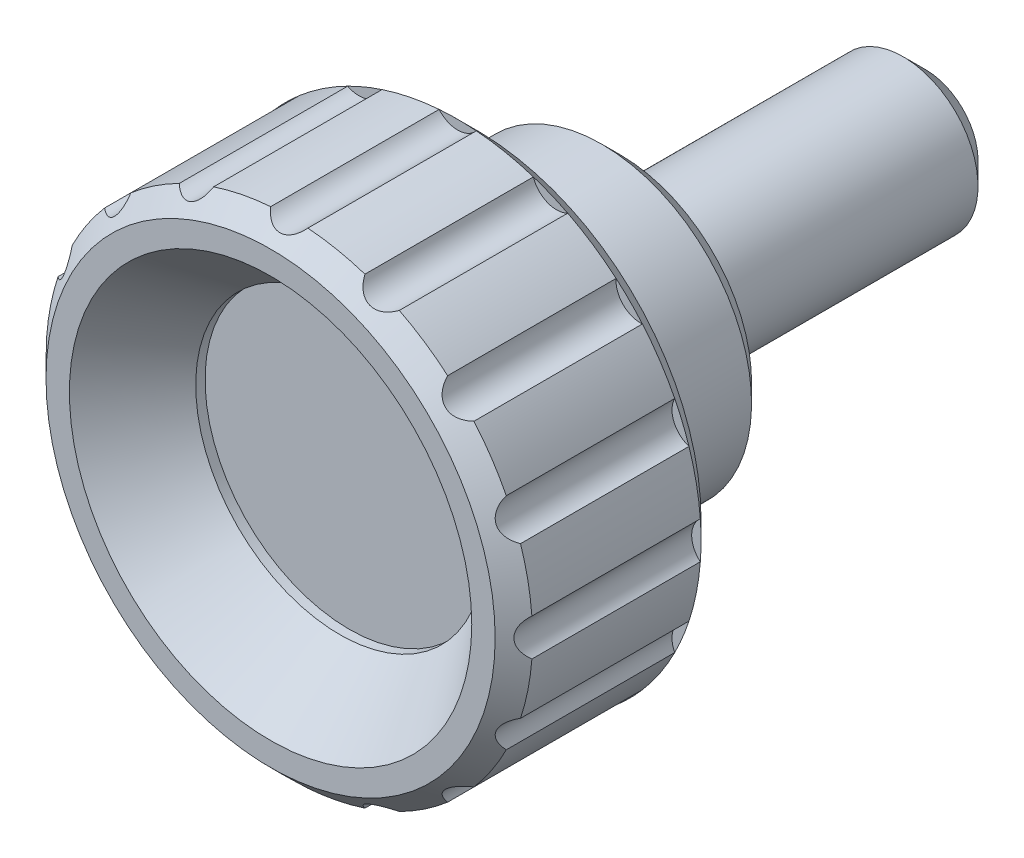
ISO-10303-21;
HEADER;
FILE_DESCRIPTION(('STEP AP214'),'2;1');
FILE_NAME('part.step','',(''),(''),'','','');
FILE_SCHEMA(('AUTOMOTIVE_DESIGN { 1 0 10303 214 1 1 1 1 }'));
ENDSEC;
DATA;
#1=APPLICATION_CONTEXT('core data for automotive mechanical design processes');
#2=APPLICATION_PROTOCOL_DEFINITION('international standard','automotive_design',2000,#1);
#3=PRODUCT_CONTEXT('',#1,'mechanical');
#4=PRODUCT('Part','Part','',(#3));
#5=PRODUCT_RELATED_PRODUCT_CATEGORY('part','',(#4));
#6=PRODUCT_DEFINITION_FORMATION('','',#4);
#7=PRODUCT_DEFINITION_CONTEXT('part definition',#1,'design');
#8=PRODUCT_DEFINITION('design','',#6,#7);
#9=PRODUCT_DEFINITION_SHAPE('','',#8);
#10=(LENGTH_UNIT() NAMED_UNIT(*) SI_UNIT(.MILLI.,.METRE.));
#11=(NAMED_UNIT(*) PLANE_ANGLE_UNIT() SI_UNIT($,.RADIAN.));
#12=(NAMED_UNIT(*) SI_UNIT($,.STERADIAN.) SOLID_ANGLE_UNIT());
#13=UNCERTAINTY_MEASURE_WITH_UNIT(LENGTH_MEASURE(1.E-05),#10,'distance_accuracy_value','');
#14=(GEOMETRIC_REPRESENTATION_CONTEXT(3) GLOBAL_UNCERTAINTY_ASSIGNED_CONTEXT((#13)) GLOBAL_UNIT_ASSIGNED_CONTEXT((#10,
#11,#12)) REPRESENTATION_CONTEXT('',''));
#15=CARTESIAN_POINT('',(0.,0.,0.));
#16=DIRECTION('',(0.,0.,1.));
#17=DIRECTION('',(1.,0.,0.));
#18=AXIS2_PLACEMENT_3D('',#15,#16,#17);
#19=CARTESIAN_POINT('',(-6.39920215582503E-13,-5.50485583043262E-13,7.99999999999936));
#20=DIRECTION('',(0.,0.,1.));
#21=DIRECTION('',(1.,0.,0.));
#22=AXIS2_PLACEMENT_3D('',#19,#20,#21);
#23=CYLINDRICAL_SURFACE('',#22,12.9999999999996);
#24=CARTESIAN_POINT('',(-1.43982048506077E-12,-1.23859256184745E-12,18.));
#25=DIRECTION('',(0.,0.,1.));
#26=DIRECTION('',(1.,0.,0.));
#27=AXIS2_PLACEMENT_3D('',#24,#25,#26);
#28=CIRCLE('',#27,12.9999999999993);
#29=CARTESIAN_POINT('',(-4.04215376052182,-12.3556057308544,17.9999999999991));
#30=VERTEX_POINT('',#29);
#31=CARTESIAN_POINT('',(-0.993822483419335,-12.9619565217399,17.9999999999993));
#32=VERTEX_POINT('',#31);
#33=EDGE_CURVE('E406',#30,#32,#28,.T.);
#34=ORIENTED_EDGE('',*,*,#33,.F.);
#35=DIRECTION('',(0.,0.,1.));
#36=VECTOR('',#35,1.);
#37=CARTESIAN_POINT('',(-4.04215376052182,-12.3556057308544,14.));
#38=LINE('',#37,#36);
#39=CARTESIAN_POINT('',(-4.04215376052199,-12.3556057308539,9.));
#40=VERTEX_POINT('',#39);
#41=EDGE_CURVE('E9',#30,#40,#38,.F.);
#42=ORIENTED_EDGE('',*,*,#41,.T.);
#43=CARTESIAN_POINT('',(-7.19910242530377E-13,-6.19296280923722E-13,9.));
#44=DIRECTION('',(0.,0.,1.));
#45=DIRECTION('',(1.,0.,0.));
#46=AXIS2_PLACEMENT_3D('',#43,#44,#45);
#47=CIRCLE('',#46,13.);
#48=CARTESIAN_POINT('',(-0.993822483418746,-12.9619565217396,8.99999999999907));
#49=VERTEX_POINT('',#48);
#50=EDGE_CURVE('E486',#40,#49,#47,.T.);
#51=ORIENTED_EDGE('',*,*,#50,.T.);
#52=DIRECTION('',(0.,0.,1.));
#53=VECTOR('',#52,1.);
#54=CARTESIAN_POINT('',(-0.993822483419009,-12.9619565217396,14.));
#55=LINE('',#54,#53);
#56=EDGE_CURVE('E337',#49,#32,#55,.T.);
#57=ORIENTED_EDGE('',*,*,#56,.T.);
#58=EDGE_LOOP('',(#34,#42,#51,#57));
#59=FACE_BOUND('',#58,.T.);
#60=ADVANCED_FACE('F14',(#59),#23,.T.);
#61=CARTESIAN_POINT('',(-8.46274873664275,-9.86822597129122,9.));
#62=VERTEX_POINT('',#61);
#63=CARTESIAN_POINT('',(-5.87849826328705,-11.5949669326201,8.99999999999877));
#64=VERTEX_POINT('',#63);
#65=EDGE_CURVE('E392',#62,#64,#47,.T.);
#66=ORIENTED_EDGE('',*,*,#65,.T.);
#67=DIRECTION('',(0.,0.,1.));
#68=VECTOR('',#67,1.);
#69=CARTESIAN_POINT('',(-5.87849826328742,-11.5949669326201,14.));
#70=LINE('',#69,#68);
#71=CARTESIAN_POINT('',(-5.87849826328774,-11.5949669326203,17.999999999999));
#72=VERTEX_POINT('',#71);
#73=EDGE_CURVE('E22',#64,#72,#70,.T.);
#74=ORIENTED_EDGE('',*,*,#73,.T.);
#75=CARTESIAN_POINT('',(-8.46274873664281,-9.86822597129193,17.9999999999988));
#76=VERTEX_POINT('',#75);
#77=EDGE_CURVE('E390',#76,#72,#28,.T.);
#78=ORIENTED_EDGE('',*,*,#77,.F.);
#79=DIRECTION('',(0.,0.,1.));
#80=VECTOR('',#79,1.);
#81=CARTESIAN_POINT('',(-8.46274873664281,-9.86822597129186,14.));
#82=LINE('',#81,#80);
#83=EDGE_CURVE('E381',#76,#62,#82,.F.);
#84=ORIENTED_EDGE('',*,*,#83,.T.);
#85=EDGE_LOOP('',(#66,#74,#78,#84));
#86=FACE_BOUND('',#85,.T.);
#87=ADVANCED_FACE('F389',(#86),#23,.T.);
#88=CARTESIAN_POINT('',(-11.5949669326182,-5.87849826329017,9.));
#89=VERTEX_POINT('',#88);
#90=CARTESIAN_POINT('',(-9.86822597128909,-8.46274873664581,8.99999999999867));
#91=VERTEX_POINT('',#90);
#92=EDGE_CURVE('E478',#89,#91,#47,.T.);
#93=ORIENTED_EDGE('',*,*,#92,.T.);
#94=DIRECTION('',(0.,0.,1.));
#95=VECTOR('',#94,1.);
#96=CARTESIAN_POINT('',(-9.86822597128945,-8.46274873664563,14.));
#97=LINE('',#96,#95);
#98=CARTESIAN_POINT('',(-9.86822597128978,-8.46274873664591,17.9999999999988));
#99=VERTEX_POINT('',#98);
#100=EDGE_CURVE('E378',#91,#99,#97,.T.);
#101=ORIENTED_EDGE('',*,*,#100,.T.);
#102=CARTESIAN_POINT('',(-11.5949669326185,-5.87849826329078,17.9999999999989));
#103=VERTEX_POINT('',#102);
#104=EDGE_CURVE('E405',#103,#99,#28,.T.);
#105=ORIENTED_EDGE('',*,*,#104,.F.);
#106=DIRECTION('',(0.,0.,1.));
#107=VECTOR('',#106,1.);
#108=CARTESIAN_POINT('',(-11.5949669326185,-5.87849826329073,14.));
#109=LINE('',#108,#107);
#110=EDGE_CURVE('E375',#103,#89,#109,.F.);
#111=ORIENTED_EDGE('',*,*,#110,.T.);
#112=EDGE_LOOP('',(#93,#101,#105,#111));
#113=FACE_BOUND('',#112,.T.);
#114=ADVANCED_FACE('F721',(#113),#23,.T.);
#115=CARTESIAN_POINT('',(-12.9619565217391,-0.993822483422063,9.));
#116=VERTEX_POINT('',#115);
#117=CARTESIAN_POINT('',(-12.3556057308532,-4.04215376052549,8.99999999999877));
#118=VERTEX_POINT('',#117);
#119=EDGE_CURVE('E467',#116,#118,#47,.T.);
#120=ORIENTED_EDGE('',*,*,#119,.T.);
#121=DIRECTION('',(0.,0.,1.));
#122=VECTOR('',#121,1.);
#123=CARTESIAN_POINT('',(-12.3556057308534,-4.0421537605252,14.));
#124=LINE('',#123,#122);
#125=CARTESIAN_POINT('',(-12.3556057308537,-4.04215376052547,17.999999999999));
#126=VERTEX_POINT('',#125);
#127=EDGE_CURVE('E372',#118,#126,#124,.T.);
#128=ORIENTED_EDGE('',*,*,#127,.T.);
#129=CARTESIAN_POINT('',(-12.9619565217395,-0.993822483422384,17.9999999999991));
#130=VERTEX_POINT('',#129);
#131=EDGE_CURVE('E407',#130,#126,#28,.T.);
#132=ORIENTED_EDGE('',*,*,#131,.F.);
#133=DIRECTION('',(0.,0.,1.));
#134=VECTOR('',#133,1.);
#135=CARTESIAN_POINT('',(-12.9619565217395,-0.993822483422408,14.));
#136=LINE('',#135,#134);
#137=EDGE_CURVE('E369',#130,#116,#136,.F.);
#138=ORIENTED_EDGE('',*,*,#137,.T.);
#139=EDGE_LOOP('',(#120,#128,#132,#138));
#140=FACE_BOUND('',#139,.T.);
#141=ADVANCED_FACE('F464',(#140),#23,.T.);
#142=CARTESIAN_POINT('',(-12.3556057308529,4.04215376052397,9.));
#143=VERTEX_POINT('',#142);
#144=CARTESIAN_POINT('',(-12.9619565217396,0.993822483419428,8.99999999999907));
#145=VERTEX_POINT('',#144);
#146=EDGE_CURVE('E1266',#143,#145,#47,.T.);
#147=ORIENTED_EDGE('',*,*,#146,.T.);
#148=DIRECTION('',(0.,0.,1.));
#149=VECTOR('',#148,1.);
#150=CARTESIAN_POINT('',(-12.9619565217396,0.993822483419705,14.));
#151=LINE('',#150,#149);
#152=CARTESIAN_POINT('',(-12.9619565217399,0.99382248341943,17.9999999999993));
#153=VERTEX_POINT('',#152);
#154=EDGE_CURVE('E366',#145,#153,#151,.T.);
#155=ORIENTED_EDGE('',*,*,#154,.T.);
#156=CARTESIAN_POINT('',(-12.3556057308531,4.04215376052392,17.9999999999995));
#157=VERTEX_POINT('',#156);
#158=EDGE_CURVE('E450',#157,#153,#28,.T.);
#159=ORIENTED_EDGE('',*,*,#158,.F.);
#160=DIRECTION('',(0.,0.,1.));
#161=VECTOR('',#160,1.);
#162=CARTESIAN_POINT('',(-12.3556057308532,4.04215376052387,14.));
#163=LINE('',#162,#161);
#164=EDGE_CURVE('E363',#157,#143,#163,.F.);
#165=ORIENTED_EDGE('',*,*,#164,.T.);
#166=EDGE_LOOP('',(#147,#155,#159,#165));
#167=FACE_BOUND('',#166,.T.);
#168=ADVANCED_FACE('F1029',(#167),#23,.T.);
#169=CARTESIAN_POINT('',(-9.86822597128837,8.46274873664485,9.));
#170=VERTEX_POINT('',#169);
#171=CARTESIAN_POINT('',(-11.5949669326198,5.8784982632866,8.99999999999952));
#172=VERTEX_POINT('',#171);
#173=EDGE_CURVE('E1261',#170,#172,#47,.T.);
#174=ORIENTED_EDGE('',*,*,#173,.T.);
#175=DIRECTION('',(0.,0.,1.));
#176=VECTOR('',#175,1.);
#177=CARTESIAN_POINT('',(-11.5949669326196,5.87849826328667,14.));
#178=LINE('',#177,#176);
#179=CARTESIAN_POINT('',(-11.5949669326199,5.87849826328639,17.9999999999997));
#180=VERTEX_POINT('',#179);
#181=EDGE_CURVE('E360',#172,#180,#178,.T.);
#182=ORIENTED_EDGE('',*,*,#181,.T.);
#183=CARTESIAN_POINT('',(-9.86822597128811,8.46274873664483,18.));
#184=VERTEX_POINT('',#183);
#185=EDGE_CURVE('E446',#184,#180,#28,.T.);
#186=ORIENTED_EDGE('',*,*,#185,.F.);
#187=DIRECTION('',(0.,0.,1.));
#188=VECTOR('',#187,1.);
#189=CARTESIAN_POINT('',(-9.86822597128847,8.46274873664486,14.));
#190=LINE('',#189,#188);
#191=EDGE_CURVE('E357',#184,#170,#190,.F.);
#192=ORIENTED_EDGE('',*,*,#191,.T.);
#193=EDGE_LOOP('',(#174,#182,#186,#192));
#194=FACE_BOUND('',#193,.T.);
#195=ADVANCED_FACE('F1036',(#194),#23,.T.);
#196=CARTESIAN_POINT('',(-5.87849826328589,11.5949669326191,9.));
#197=VERTEX_POINT('',#196);
#198=CARTESIAN_POINT('',(-8.46274873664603,9.86822597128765,9.));
#199=VERTEX_POINT('',#198);
#200=EDGE_CURVE('E1259',#197,#199,#47,.T.);
#201=ORIENTED_EDGE('',*,*,#200,.T.);
#202=DIRECTION('',(0.,0.,1.));
#203=VECTOR('',#202,1.);
#204=CARTESIAN_POINT('',(-8.4627487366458,9.86822597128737,14.));
#205=LINE('',#204,#203);
#206=CARTESIAN_POINT('',(-8.46274873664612,9.86822597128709,18.));
#207=VERTEX_POINT('',#206);
#208=EDGE_CURVE('E354',#199,#207,#205,.T.);
#209=ORIENTED_EDGE('',*,*,#208,.T.);
#210=CARTESIAN_POINT('',(-5.87849826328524,11.5949669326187,18.0000000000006));
#211=VERTEX_POINT('',#210);
#212=EDGE_CURVE('E442',#211,#207,#28,.T.);
#213=ORIENTED_EDGE('',*,*,#212,.F.);
#214=DIRECTION('',(0.,0.,1.));
#215=VECTOR('',#214,1.);
#216=CARTESIAN_POINT('',(-5.87849826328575,11.594966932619,14.));
#217=LINE('',#216,#215);
#218=EDGE_CURVE('E351',#211,#197,#217,.F.);
#219=ORIENTED_EDGE('',*,*,#218,.T.);
#220=EDGE_LOOP('',(#201,#209,#213,#219));
#221=FACE_BOUND('',#220,.T.);
#222=ADVANCED_FACE('F1044',(#221),#23,.T.);
#223=CARTESIAN_POINT('',(-0.993822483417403,12.9619565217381,9.));
#224=VERTEX_POINT('',#223);
#225=CARTESIAN_POINT('',(-4.04215376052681,12.3556057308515,9.00000000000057));
#226=VERTEX_POINT('',#225);
#227=EDGE_CURVE('E259',#224,#226,#47,.T.);
#228=ORIENTED_EDGE('',*,*,#227,.T.);
#229=DIRECTION('',(0.,0.,1.));
#230=VECTOR('',#229,1.);
#231=CARTESIAN_POINT('',(-4.04215376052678,12.3556057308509,14.));
#232=LINE('',#231,#230);
#233=CARTESIAN_POINT('',(-4.0421537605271,12.3556057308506,18.0000000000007));
#234=VERTEX_POINT('',#233);
#235=EDGE_CURVE('E348',#226,#234,#232,.T.);
#236=ORIENTED_EDGE('',*,*,#235,.T.);
#237=CARTESIAN_POINT('',(-0.993822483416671,12.9619565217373,18.0000000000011));
#238=VERTEX_POINT('',#237);
#239=EDGE_CURVE('E439',#238,#234,#28,.T.);
#240=ORIENTED_EDGE('',*,*,#239,.F.);
#241=DIRECTION('',(0.,0.,1.));
#242=VECTOR('',#241,1.);
#243=CARTESIAN_POINT('',(-0.993822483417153,12.9619565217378,14.));
#244=LINE('',#243,#242);
#245=EDGE_CURVE('E345',#238,#224,#244,.F.);
#246=ORIENTED_EDGE('',*,*,#245,.T.);
#247=EDGE_LOOP('',(#228,#236,#240,#246));
#248=FACE_BOUND('',#247,.T.);
#249=ADVANCED_FACE('F1052',(#248),#23,.T.);
#250=CARTESIAN_POINT('',(0.993822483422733,-12.9619565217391,17.9999999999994));
#251=VERTEX_POINT('',#250);
#252=CARTESIAN_POINT('',(4.04215376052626,-12.3556057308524,17.9999999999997));
#253=VERTEX_POINT('',#252);
#254=EDGE_CURVE('E408',#251,#253,#28,.T.);
#255=ORIENTED_EDGE('',*,*,#254,.F.);
#256=DIRECTION('',(0.,0.,1.));
#257=VECTOR('',#256,1.);
#258=CARTESIAN_POINT('',(0.993822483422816,-12.9619565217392,14.));
#259=LINE('',#258,#257);
#260=CARTESIAN_POINT('',(0.993822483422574,-12.9619565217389,9.));
#261=VERTEX_POINT('',#260);
#262=EDGE_CURVE('E340',#251,#261,#259,.F.);
#263=ORIENTED_EDGE('',*,*,#262,.T.);
#264=CARTESIAN_POINT('',(4.04215376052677,-12.3556057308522,8.99999999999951));
#265=VERTEX_POINT('',#264);
#266=EDGE_CURVE('E492',#261,#265,#47,.T.);
#267=ORIENTED_EDGE('',*,*,#266,.T.);
#268=DIRECTION('',(0.,0.,1.));
#269=VECTOR('',#268,1.);
#270=CARTESIAN_POINT('',(4.04215376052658,-12.3556057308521,14.));
#271=LINE('',#270,#269);
#272=EDGE_CURVE('E331',#265,#253,#271,.T.);
#273=ORIENTED_EDGE('',*,*,#272,.T.);
#274=EDGE_LOOP('',(#255,#263,#267,#273));
#275=FACE_BOUND('',#274,.T.);
#276=ADVANCED_FACE('F1060',(#275),#23,.T.);
#277=CARTESIAN_POINT('',(5.87849826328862,-11.594966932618,18.));
#278=VERTEX_POINT('',#277);
#279=CARTESIAN_POINT('',(8.46274873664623,-9.86822597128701,18.));
#280=VERTEX_POINT('',#279);
#281=EDGE_CURVE('E411',#278,#280,#28,.T.);
#282=ORIENTED_EDGE('',*,*,#281,.F.);
#283=DIRECTION('',(0.,0.,1.));
#284=VECTOR('',#283,1.);
#285=CARTESIAN_POINT('',(5.87849826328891,-11.5949669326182,14.));
#286=LINE('',#285,#284);
#287=CARTESIAN_POINT('',(5.87849826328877,-11.5949669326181,9.));
#288=VERTEX_POINT('',#287);
#289=EDGE_CURVE('E334',#278,#288,#286,.F.);
#290=ORIENTED_EDGE('',*,*,#289,.T.);
#291=CARTESIAN_POINT('',(8.46274873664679,-9.868225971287,9.));
#292=VERTEX_POINT('',#291);
#293=EDGE_CURVE('E500',#288,#292,#47,.T.);
#294=ORIENTED_EDGE('',*,*,#293,.T.);
#295=DIRECTION('',(0.,0.,1.));
#296=VECTOR('',#295,1.);
#297=CARTESIAN_POINT('',(8.46274873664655,-9.86822597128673,14.));
#298=LINE('',#297,#296);
#299=EDGE_CURVE('E325',#292,#280,#298,.T.);
#300=ORIENTED_EDGE('',*,*,#299,.T.);
#301=EDGE_LOOP('',(#282,#290,#294,#300));
#302=FACE_BOUND('',#301,.T.);
#303=ADVANCED_FACE('F761',(#302),#23,.T.);
#304=CARTESIAN_POINT('',(9.86822597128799,-8.46274873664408,18.0000000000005));
#305=VERTEX_POINT('',#304);
#306=CARTESIAN_POINT('',(11.5949669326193,-5.87849826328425,18.0000000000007));
#307=VERTEX_POINT('',#306);
#308=EDGE_CURVE('E415',#305,#307,#28,.T.);
#309=ORIENTED_EDGE('',*,*,#308,.F.);
#310=DIRECTION('',(0.,0.,1.));
#311=VECTOR('',#310,1.);
#312=CARTESIAN_POINT('',(9.86822597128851,-8.46274873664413,14.));
#313=LINE('',#312,#311);
#314=CARTESIAN_POINT('',(9.86822597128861,-8.46274873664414,9.));
#315=VERTEX_POINT('',#314);
#316=EDGE_CURVE('E328',#305,#315,#313,.F.);
#317=ORIENTED_EDGE('',*,*,#316,.T.);
#318=CARTESIAN_POINT('',(11.5949669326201,-5.87849826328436,9.00000000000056));
#319=VERTEX_POINT('',#318);
#320=EDGE_CURVE('E508',#315,#319,#47,.T.);
#321=ORIENTED_EDGE('',*,*,#320,.T.);
#322=DIRECTION('',(0.,0.,1.));
#323=VECTOR('',#322,1.);
#324=CARTESIAN_POINT('',(11.5949669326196,-5.87849826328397,14.));
#325=LINE('',#324,#323);
#326=EDGE_CURVE('E319',#319,#307,#325,.T.);
#327=ORIENTED_EDGE('',*,*,#326,.T.);
#328=EDGE_LOOP('',(#309,#317,#321,#327));
#329=FACE_BOUND('',#328,.T.);
#330=ADVANCED_FACE('F1074',(#329),#23,.T.);
#331=CARTESIAN_POINT('',(12.3556057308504,-4.04215376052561,18.0000000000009));
#332=VERTEX_POINT('',#331);
#333=CARTESIAN_POINT('',(12.9619565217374,-0.993822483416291,18.0000000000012));
#334=VERTEX_POINT('',#333);
#335=EDGE_CURVE('E419',#332,#334,#28,.T.);
#336=ORIENTED_EDGE('',*,*,#335,.F.);
#337=DIRECTION('',(0.,0.,1.));
#338=VECTOR('',#337,1.);
#339=CARTESIAN_POINT('',(12.3556057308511,-4.04215376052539,14.));
#340=LINE('',#339,#338);
#341=CARTESIAN_POINT('',(12.3556057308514,-4.04215376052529,9.));
#342=VERTEX_POINT('',#341);
#343=EDGE_CURVE('E322',#332,#342,#340,.F.);
#344=ORIENTED_EDGE('',*,*,#343,.T.);
#345=CARTESIAN_POINT('',(12.9619565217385,-0.993822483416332,9.00000000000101));
#346=VERTEX_POINT('',#345);
#347=EDGE_CURVE('E432',#342,#346,#47,.T.);
#348=ORIENTED_EDGE('',*,*,#347,.T.);
#349=DIRECTION('',(0.,0.,1.));
#350=VECTOR('',#349,1.);
#351=CARTESIAN_POINT('',(12.9619565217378,-0.993822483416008,14.));
#352=LINE('',#351,#350);
#353=EDGE_CURVE('E313',#346,#334,#352,.T.);
#354=ORIENTED_EDGE('',*,*,#353,.T.);
#355=EDGE_LOOP('',(#336,#344,#348,#354));
#356=FACE_BOUND('',#355,.T.);
#357=ADVANCED_FACE('F520',(#356),#23,.T.);
#358=CARTESIAN_POINT('',(12.9619565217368,0.99382248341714,18.0000000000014));
#359=VERTEX_POINT('',#358);
#360=CARTESIAN_POINT('',(12.3556057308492,4.042153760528,18.0000000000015));
#361=VERTEX_POINT('',#360);
#362=EDGE_CURVE('E267',#359,#361,#28,.T.);
#363=ORIENTED_EDGE('',*,*,#362,.F.);
#364=DIRECTION('',(0.,0.,1.));
#365=VECTOR('',#364,1.);
#366=CARTESIAN_POINT('',(12.9619565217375,0.993822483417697,14.));
#367=LINE('',#366,#365);
#368=CARTESIAN_POINT('',(12.9619565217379,0.993822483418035,9.));
#369=VERTEX_POINT('',#368);
#370=EDGE_CURVE('E316',#359,#369,#367,.F.);
#371=ORIENTED_EDGE('',*,*,#370,.T.);
#372=CARTESIAN_POINT('',(12.3556057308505,4.0421537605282,9.00000000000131));
#373=VERTEX_POINT('',#372);
#374=EDGE_CURVE('E260',#369,#373,#47,.T.);
#375=ORIENTED_EDGE('',*,*,#374,.T.);
#376=DIRECTION('',(0.,0.,1.));
#377=VECTOR('',#376,1.);
#378=CARTESIAN_POINT('',(12.3556057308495,4.04215376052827,14.));
#379=LINE('',#378,#377);
#380=EDGE_CURVE('E307',#373,#361,#379,.T.);
#381=ORIENTED_EDGE('',*,*,#380,.T.);
#382=EDGE_LOOP('',(#363,#371,#375,#381));
#383=FACE_BOUND('',#382,.T.);
#384=ADVANCED_FACE('F529',(#383),#23,.T.);
#385=CARTESIAN_POINT('',(11.5949669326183,5.87849826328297,18.0000000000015));
#386=VERTEX_POINT('',#385);
#387=CARTESIAN_POINT('',(9.86822597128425,8.46274873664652,18.0000000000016));
#388=VERTEX_POINT('',#387);
#389=EDGE_CURVE('E429',#386,#388,#28,.T.);
#390=ORIENTED_EDGE('',*,*,#389,.F.);
#391=DIRECTION('',(0.,0.,1.));
#392=VECTOR('',#391,1.);
#393=CARTESIAN_POINT('',(11.5949669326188,5.87849826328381,14.));
#394=LINE('',#393,#392);
#395=CARTESIAN_POINT('',(11.594966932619,5.87849826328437,9.));
#396=VERTEX_POINT('',#395);
#397=EDGE_CURVE('E310',#386,#396,#394,.F.);
#398=ORIENTED_EDGE('',*,*,#397,.T.);
#399=CARTESIAN_POINT('',(9.86822597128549,8.46274873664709,9.00000000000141));
#400=VERTEX_POINT('',#399);
#401=EDGE_CURVE('E538',#396,#400,#47,.T.);
#402=ORIENTED_EDGE('',*,*,#401,.T.);
#403=DIRECTION('',(0.,0.,1.));
#404=VECTOR('',#403,1.);
#405=CARTESIAN_POINT('',(9.86822597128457,8.4627487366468,14.));
#406=LINE('',#405,#404);
#407=EDGE_CURVE('E251',#400,#388,#406,.T.);
#408=ORIENTED_EDGE('',*,*,#407,.T.);
#409=EDGE_LOOP('',(#390,#398,#402,#408));
#410=FACE_BOUND('',#409,.T.);
#411=ADVANCED_FACE('F1093',(#410),#23,.T.);
#412=CARTESIAN_POINT('',(8.4627487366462,9.86822597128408,18.0000000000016));
#413=VERTEX_POINT('',#412);
#414=CARTESIAN_POINT('',(5.87849826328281,11.5949669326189,18.0000000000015));
#415=VERTEX_POINT('',#414);
#416=EDGE_CURVE('E434',#413,#415,#28,.T.);
#417=ORIENTED_EDGE('',*,*,#416,.F.);
#418=DIRECTION('',(0.,0.,1.));
#419=VECTOR('',#418,1.);
#420=CARTESIAN_POINT('',(8.46274873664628,9.86822597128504,14.));
#421=LINE('',#420,#419);
#422=CARTESIAN_POINT('',(8.46274873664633,9.86822597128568,9.));
#423=VERTEX_POINT('',#422);
#424=EDGE_CURVE('E304',#413,#423,#421,.F.);
#425=ORIENTED_EDGE('',*,*,#424,.T.);
#426=CARTESIAN_POINT('',(5.87849826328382,11.5949669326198,9.00000000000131));
#427=VERTEX_POINT('',#426);
#428=EDGE_CURVE('E231',#423,#427,#47,.T.);
#429=ORIENTED_EDGE('',*,*,#428,.T.);
#430=DIRECTION('',(0.,0.,1.));
#431=VECTOR('',#430,1.);
#432=CARTESIAN_POINT('',(5.87849826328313,11.5949669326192,14.));
#433=LINE('',#432,#431);
#434=EDGE_CURVE('E240',#427,#415,#433,.T.);
#435=ORIENTED_EDGE('',*,*,#434,.T.);
#436=EDGE_LOOP('',(#417,#425,#429,#435));
#437=FACE_BOUND('',#436,.T.);
#438=ADVANCED_FACE('F545',(#437),#23,.T.);
#439=CARTESIAN_POINT('',(10.2499999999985,-1.30740325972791E-12,19.0000000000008));
#440=DIRECTION('',(0.,0.,1.));
#441=DIRECTION('',(0.,-1.,0.));
#442=AXIS2_PLACEMENT_3D('',#439,#440,#441);
#443=PLANE('',#442);
#444=CARTESIAN_POINT('',(-1.51981051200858E-12,-1.30740325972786E-12,19.));
#445=DIRECTION('',(0.,0.,1.));
#446=DIRECTION('',(1.,0.,0.));
#447=AXIS2_PLACEMENT_3D('',#444,#445,#446);
#448=CIRCLE('',#447,11.9999999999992);
#449=CARTESIAN_POINT('',(11.9999999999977,-1.30740325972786E-12,19.000000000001));
#450=VERTEX_POINT('',#449);
#451=EDGE_CURVE('E271',#450,#450,#448,.T.);
#452=ORIENTED_EDGE('',*,*,#451,.T.);
#453=EDGE_LOOP('',(#452));
#454=FACE_BOUND('',#453,.T.);
#455=CARTESIAN_POINT('',(-1.51981051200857E-12,-1.30740325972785E-12,19.));
#456=DIRECTION('',(0.,0.,1.));
#457=DIRECTION('',(1.,0.,0.));
#458=AXIS2_PLACEMENT_3D('',#455,#456,#457);
#459=CIRCLE('',#458,10.75);
#460=CARTESIAN_POINT('',(10.7499999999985,-1.30740325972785E-12,19.0000000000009));
#461=VERTEX_POINT('',#460);
#462=EDGE_CURVE('E423',#461,#461,#459,.T.);
#463=ORIENTED_EDGE('',*,*,#462,.F.);
#464=EDGE_LOOP('',(#463));
#465=FACE_BOUND('',#464,.T.);
#466=ADVANCED_FACE('F1105',(#454,#465),#443,.T.);
#467=CARTESIAN_POINT('',(7.,0.,0.30000000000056));
#468=DIRECTION('',(0.,0.,-1.));
#469=DIRECTION('',(0.,1.,0.));
#470=AXIS2_PLACEMENT_3D('',#467,#468,#469);
#471=PLANE('',#470);
#472=CARTESIAN_POINT('',(0.,0.,0.3));
#473=DIRECTION('',(0.,0.,-1.));
#474=DIRECTION('',(0.,1.,0.));
#475=AXIS2_PLACEMENT_3D('',#472,#473,#474);
#476=CIRCLE('',#475,7.);
#477=CARTESIAN_POINT('',(0.,6.99999999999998,0.300000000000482));
#478=VERTEX_POINT('',#477);
#479=EDGE_CURVE('E281',#478,#478,#476,.T.);
#480=ORIENTED_EDGE('',*,*,#479,.T.);
#481=EDGE_LOOP('',(#480));
#482=FACE_BOUND('',#481,.T.);
#483=CARTESIAN_POINT('',(0.,0.,0.3));
#484=DIRECTION('',(0.,0.,-1.));
#485=DIRECTION('',(-1.,0.,0.));
#486=AXIS2_PLACEMENT_3D('',#483,#484,#485);
#487=CIRCLE('',#486,4.8);
#488=CARTESIAN_POINT('',(-4.80000000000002,0.,0.299999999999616));
#489=VERTEX_POINT('',#488);
#490=EDGE_CURVE('E274',#489,#489,#487,.T.);
#491=ORIENTED_EDGE('',*,*,#490,.F.);
#492=EDGE_LOOP('',(#491));
#493=FACE_BOUND('',#492,.T.);
#494=ADVANCED_FACE('F1111',(#482,#493),#471,.T.);
#495=CARTESIAN_POINT('',(11.4999999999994,-5.50485583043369E-13,8.00000000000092));
#496=DIRECTION('',(0.,0.,-1.));
#497=DIRECTION('',(0.,1.,0.));
#498=AXIS2_PLACEMENT_3D('',#495,#496,#497);
#499=PLANE('',#498);
#500=CARTESIAN_POINT('',(-6.39920215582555E-13,-5.50485583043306E-13,8.));
#501=DIRECTION('',(0.,0.,-1.));
#502=DIRECTION('',(0.,1.,0.));
#503=AXIS2_PLACEMENT_3D('',#500,#501,#502);
#504=CIRCLE('',#503,8.);
#505=CARTESIAN_POINT('',(-6.39920215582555E-13,7.99999999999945,8.00000000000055));
#506=VERTEX_POINT('',#505);
#507=EDGE_CURVE('E287',#506,#506,#504,.T.);
#508=ORIENTED_EDGE('',*,*,#507,.F.);
#509=EDGE_LOOP('',(#508));
#510=FACE_BOUND('',#509,.T.);
#511=CARTESIAN_POINT('',(-6.39920215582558E-13,-5.50485583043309E-13,8.));
#512=DIRECTION('',(0.,0.,1.));
#513=DIRECTION('',(1.,0.,0.));
#514=AXIS2_PLACEMENT_3D('',#511,#512,#513);
#515=CIRCLE('',#514,12.);
#516=CARTESIAN_POINT('',(11.9999999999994,-5.50485583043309E-13,8.00000000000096));
#517=VERTEX_POINT('',#516);
#518=EDGE_CURVE('E264',#517,#517,#515,.T.);
#519=ORIENTED_EDGE('',*,*,#518,.F.);
#520=EDGE_LOOP('',(#519));
#521=FACE_BOUND('',#520,.T.);
#522=ADVANCED_FACE('F1120',(#510,#521),#499,.T.);
#523=CARTESIAN_POINT('',(0.,0.,0.3));
#524=DIRECTION('',(0.,0.,-1.));
#525=DIRECTION('',(0.,1.,0.));
#526=AXIS2_PLACEMENT_3D('',#523,#524,#525);
#527=CYLINDRICAL_SURFACE('',#526,8.);
#528=ORIENTED_EDGE('',*,*,#507,.T.);
#529=EDGE_LOOP('',(#528));
#530=FACE_BOUND('',#529,.T.);
#531=CARTESIAN_POINT('',(-1.03987035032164E-13,0.,1.3));
#532=DIRECTION('',(0.,0.,-1.));
#533=DIRECTION('',(0.,1.,0.));
#534=AXIS2_PLACEMENT_3D('',#531,#532,#533);
#535=CIRCLE('',#534,8.);
#536=CARTESIAN_POINT('',(-1.03987035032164E-13,7.99999999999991,1.30000000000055));
#537=VERTEX_POINT('',#536);
#538=EDGE_CURVE('E284',#537,#537,#535,.T.);
#539=ORIENTED_EDGE('',*,*,#538,.F.);
#540=EDGE_LOOP('',(#539));
#541=FACE_BOUND('',#540,.T.);
#542=ADVANCED_FACE('F1130',(#530,#541),#527,.T.);
#543=CARTESIAN_POINT('',(0.,0.,0.3));
#544=DIRECTION('',(0.,0.,1.));
#545=DIRECTION('',(0.,-1.,0.));
#546=AXIS2_PLACEMENT_3D('',#543,#544,#545);
#547=CONICAL_SURFACE('',#546,7.,0.785398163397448);
#548=ORIENTED_EDGE('',*,*,#538,.T.);
#549=EDGE_LOOP('',(#548));
#550=FACE_BOUND('',#549,.T.);
#551=ORIENTED_EDGE('',*,*,#479,.F.);
#552=EDGE_LOOP('',(#551));
#553=FACE_BOUND('',#552,.T.);
#554=ADVANCED_FACE('F1139',(#550,#553),#547,.T.);
#555=CARTESIAN_POINT('',(0.,0.,0.));
#556=DIRECTION('',(0.,0.,-1.));
#557=DIRECTION('',(-1.,0.,0.));
#558=AXIS2_PLACEMENT_3D('',#555,#556,#557);
#559=PLANE('',#558);
#560=CARTESIAN_POINT('',(0.,0.,0.));
#561=DIRECTION('',(0.,0.,-1.));
#562=DIRECTION('',(-1.,0.,0.));
#563=AXIS2_PLACEMENT_3D('',#560,#561,#562);
#564=CIRCLE('',#563,4.8);
#565=CARTESIAN_POINT('',(-4.8,0.,-3.83897919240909E-13));
#566=VERTEX_POINT('',#565);
#567=EDGE_CURVE('E275',#566,#566,#564,.T.);
#568=ORIENTED_EDGE('',*,*,#567,.T.);
#569=EDGE_LOOP('',(#568));
#570=FACE_BOUND('',#569,.T.);
#571=CARTESIAN_POINT('',(0.,0.,0.));
#572=DIRECTION('',(0.,0.,-1.));
#573=DIRECTION('',(-1.,0.,0.));
#574=AXIS2_PLACEMENT_3D('',#571,#572,#573);
#575=CIRCLE('',#574,4.);
#576=CARTESIAN_POINT('',(-4.,0.,-3.19905897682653E-13));
#577=VERTEX_POINT('',#576);
#578=EDGE_CURVE('E278',#577,#577,#575,.T.);
#579=ORIENTED_EDGE('',*,*,#578,.F.);
#580=EDGE_LOOP('',(#579));
#581=FACE_BOUND('',#580,.T.);
#582=ADVANCED_FACE('F1148',(#570,#581),#559,.T.);
#583=CARTESIAN_POINT('',(0.,0.,0.));
#584=DIRECTION('',(0.,0.,1.));
#585=DIRECTION('',(1.,0.,0.));
#586=AXIS2_PLACEMENT_3D('',#583,#584,#585);
#587=CYLINDRICAL_SURFACE('',#586,4.8);
#588=ORIENTED_EDGE('',*,*,#567,.F.);
#589=EDGE_LOOP('',(#588));
#590=FACE_BOUND('',#589,.T.);
#591=ORIENTED_EDGE('',*,*,#490,.T.);
#592=EDGE_LOOP('',(#591));
#593=FACE_BOUND('',#592,.T.);
#594=ADVANCED_FACE('F1156',(#590,#593),#587,.T.);
#595=CARTESIAN_POINT('',(1.27984043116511E-12,1.10097116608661E-12,-16.));
#596=DIRECTION('',(0.,0.,-1.));
#597=DIRECTION('',(-1.,0.,0.));
#598=AXIS2_PLACEMENT_3D('',#595,#596,#597);
#599=PLANE('',#598);
#600=CARTESIAN_POINT('',(1.27984043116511E-12,1.10097116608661E-12,-16.));
#601=DIRECTION('',(0.,0.,-1.));
#602=DIRECTION('',(-1.,0.,0.));
#603=AXIS2_PLACEMENT_3D('',#600,#601,#602);
#604=CIRCLE('',#603,2.8);
#605=CARTESIAN_POINT('',(-2.79999999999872,1.10097116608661E-12,-16.0000000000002));
#606=VERTEX_POINT('',#605);
#607=EDGE_CURVE('E293',#606,#606,#604,.T.);
#608=ORIENTED_EDGE('',*,*,#607,.T.);
#609=EDGE_LOOP('',(#608));
#610=FACE_BOUND('',#609,.T.);
#611=ADVANCED_FACE('F1163',(#610),#599,.T.);
#612=CARTESIAN_POINT('',(1.27984043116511E-12,1.10097116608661E-12,-16.));
#613=DIRECTION('',(0.,0.,1.));
#614=DIRECTION('',(1.,0.,0.));
#615=AXIS2_PLACEMENT_3D('',#612,#613,#614);
#616=CONICAL_SURFACE('',#615,2.8,0.785398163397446);
#617=CARTESIAN_POINT('',(1.18385239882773E-12,1.01839832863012E-12,-14.8));
#618=DIRECTION('',(0.,0.,-1.));
#619=DIRECTION('',(-1.,0.,0.));
#620=AXIS2_PLACEMENT_3D('',#617,#618,#619);
#621=CIRCLE('',#620,4.);
#622=CARTESIAN_POINT('',(-3.99999999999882,1.01839832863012E-12,-14.8000000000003));
#623=VERTEX_POINT('',#622);
#624=EDGE_CURVE('E296',#623,#623,#621,.F.);
#625=ORIENTED_EDGE('',*,*,#624,.F.);
#626=EDGE_LOOP('',(#625));
#627=FACE_BOUND('',#626,.T.);
#628=ORIENTED_EDGE('',*,*,#607,.F.);
#629=EDGE_LOOP('',(#628));
#630=FACE_BOUND('',#629,.T.);
#631=ADVANCED_FACE('F16',(#627,#630),#616,.T.);
#632=CARTESIAN_POINT('',(0.,0.,0.));
#633=DIRECTION('',(0.,0.,1.));
#634=DIRECTION('',(1.,0.,0.));
#635=AXIS2_PLACEMENT_3D('',#632,#633,#634);
#636=CYLINDRICAL_SURFACE('',#635,4.);
#637=ORIENTED_EDGE('',*,*,#578,.T.);
#638=EDGE_LOOP('',(#637));
#639=FACE_BOUND('',#638,.T.);
#640=ORIENTED_EDGE('',*,*,#624,.T.);
#641=EDGE_LOOP('',(#640));
#642=FACE_BOUND('',#641,.T.);
#643=ADVANCED_FACE('F714',(#639,#642),#636,.T.);
#644=CARTESIAN_POINT('',(-1.43982048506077E-12,-1.23859256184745E-12,18.));
#645=DIRECTION('',(0.,0.,-1.));
#646=DIRECTION('',(-1.,0.,0.));
#647=AXIS2_PLACEMENT_3D('',#644,#645,#646);
#648=CONICAL_SURFACE('',#647,12.9999999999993,0.785398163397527);
#649=ORIENTED_EDGE('',*,*,#451,.F.);
#650=EDGE_LOOP('',(#649));
#651=FACE_BOUND('',#650,.T.);
#652=ORIENTED_EDGE('',*,*,#77,.T.);
#653=CARTESIAN_POINT('',(-5.8787171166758,-11.5950802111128,17.9997999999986));
#654=CARTESIAN_POINT('',(-5.84928597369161,-11.5798521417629,18.0266898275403));
#655=CARTESIAN_POINT('',(-5.81895371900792,-11.5655672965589,18.0531049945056));
#656=CARTESIAN_POINT('',(-5.75637175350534,-11.5390770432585,18.1048217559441));
#657=CARTESIAN_POINT('',(-5.72411817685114,-11.5268760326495,18.1301209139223));
#658=CARTESIAN_POINT('',(-5.62378947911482,-11.4935463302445,18.2044510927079));
#659=CARTESIAN_POINT('',(-5.5527675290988,-11.4760237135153,18.251335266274));
#660=CARTESIAN_POINT('',(-5.42531861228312,-11.4564586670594,18.3239368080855));
#661=CARTESIAN_POINT('',(-5.37060424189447,-11.4514062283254,18.3518558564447));
#662=CARTESIAN_POINT('',(-5.25848601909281,-11.4485329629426,18.4016637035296));
#663=CARTESIAN_POINT('',(-5.20109495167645,-11.4506806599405,18.4235782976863));
#664=CARTESIAN_POINT('',(-5.09393831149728,-11.4621269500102,18.457019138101));
#665=CARTESIAN_POINT('',(-5.04439157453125,-11.4702488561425,18.4696366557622));
#666=CARTESIAN_POINT('',(-4.94543096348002,-11.4925807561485,18.4886362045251));
#667=CARTESIAN_POINT('',(-4.89601708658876,-11.5067906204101,18.4950183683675));
#668=CARTESIAN_POINT('',(-4.79873736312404,-11.5412079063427,18.501011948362));
#669=CARTESIAN_POINT('',(-4.75087591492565,-11.5614309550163,18.5006055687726));
#670=CARTESIAN_POINT('',(-4.65835169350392,-11.6071997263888,18.4930150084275));
#671=CARTESIAN_POINT('',(-4.61368935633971,-11.6327461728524,18.4858299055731));
#672=CARTESIAN_POINT('',(-4.53038775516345,-11.687035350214,18.4656900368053));
#673=CARTESIAN_POINT('',(-4.49158013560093,-11.7156116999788,18.4529747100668));
#674=CARTESIAN_POINT('',(-4.4184843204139,-11.7757528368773,18.4226654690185));
#675=CARTESIAN_POINT('',(-4.38419765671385,-11.8073186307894,18.4050699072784));
#676=CARTESIAN_POINT('',(-4.30512735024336,-11.8880598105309,18.3565675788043));
#677=CARTESIAN_POINT('',(-4.26307152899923,-11.9384900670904,18.3233046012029));
#678=CARTESIAN_POINT('',(-4.18858929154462,-12.0419659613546,18.2504718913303));
#679=CARTESIAN_POINT('',(-4.1561932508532,-12.0950192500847,18.2108828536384));
#680=CARTESIAN_POINT('',(-4.11040101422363,-12.182867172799,18.1424390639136));
#681=CARTESIAN_POINT('',(-4.09436816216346,-12.2173373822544,18.1148701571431));
#682=CARTESIAN_POINT('',(-4.06572380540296,-12.2864807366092,18.0583181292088));
#683=CARTESIAN_POINT('',(-4.05310887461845,-12.3211536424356,18.0293364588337));
#684=CARTESIAN_POINT('',(-4.04207910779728,-12.3558405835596,17.9997999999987));
#685=B_SPLINE_CURVE_WITH_KNOTS('',3,(#653,#654,#655,#656,#657,#658,#659,#660,#661,#662,#663,
#664,#665,#666,#667,#668,#669,#670,#671,#672,#673,#674,#675,#676,#677,#678,#679,#680,#681,#682,
#683,#684),.UNSPECIFIED.,.F.,.F.,(4,2,2,2,2,2,2,2,2,2,2,2,2,2,2,4),(0.,0.127963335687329,
0.256193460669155,0.515365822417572,0.699649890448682,0.883129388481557,1.03777780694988,
1.19242293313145,1.34747351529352,1.50254519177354,1.65148353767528,1.80047222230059,
2.02008153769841,2.24037431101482,2.38112116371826,2.52172640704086),.UNSPECIFIED.);
#686=EDGE_CURVE('E401',#72,#30,#685,.T.);
#687=ORIENTED_EDGE('',*,*,#686,.T.);
#688=ORIENTED_EDGE('',*,*,#33,.T.);
#689=CARTESIAN_POINT('',(-0.993981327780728,-12.9621449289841,17.9998000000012));
#690=CARTESIAN_POINT('',(-0.972618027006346,-12.9368132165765,18.0266898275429));
#691=CARTESIAN_POINT('',(-0.95006125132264,-12.9120080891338,18.053104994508));
#692=CARTESIAN_POINT('',(-0.902380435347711,-12.8635852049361,18.1048217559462));
#693=CARTESIAN_POINT('',(-0.877251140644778,-12.8399700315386,18.1301209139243));
#694=CARTESIAN_POINT('',(-0.797314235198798,-12.7707832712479,18.2044510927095));
#695=CARTESIAN_POINT('',(-0.738404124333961,-12.7274155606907,18.2513352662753));
#696=CARTESIAN_POINT('',(-0.62814389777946,-12.6605672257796,18.3239368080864));
#697=CARTESIAN_POINT('',(-0.579527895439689,-12.634961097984,18.3518558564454));
#698=CARTESIAN_POINT('',(-0.47704371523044,-12.5894007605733,18.4016637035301));
#699=CARTESIAN_POINT('',(-0.423199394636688,-12.5694223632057,18.4235782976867));
#700=CARTESIAN_POINT('',(-0.319819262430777,-12.5389902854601,18.4570191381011));
#701=CARTESIAN_POINT('',(-0.27093592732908,-12.5275332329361,18.4696366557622));
#702=CARTESIAN_POINT('',(-0.170962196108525,-12.5102946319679,18.4886362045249));
#703=CARTESIAN_POINT('',(-0.119871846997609,-12.5045129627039,18.4950183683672));
#704=CARTESIAN_POINT('',(-0.0168261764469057,-12.4990830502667,18.5010119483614));
#705=CARTESIAN_POINT('',(0.0351310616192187,-12.4994509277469,18.500605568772));
#706=CARTESIAN_POINT('',(0.138127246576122,-12.5063282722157,18.4930150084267));
#707=CARTESIAN_POINT('',(0.189166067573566,-12.5128385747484,18.4858299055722));
#708=CARTESIAN_POINT('',(0.286902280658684,-12.5311170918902,18.4656900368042));
#709=CARTESIAN_POINT('',(0.333691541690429,-12.5426671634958,18.4529747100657));
#710=CARTESIAN_POINT('',(0.424238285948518,-12.570257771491,18.4226654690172));
#711=CARTESIAN_POINT('',(0.467994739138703,-12.5862998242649,18.4050699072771));
#712=CARTESIAN_POINT('',(0.571944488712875,-12.6306360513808,18.3565675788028));
#713=CARTESIAN_POINT('',(0.630097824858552,-12.6611334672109,18.3233046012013));
#714=CARTESIAN_POINT('',(0.738508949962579,-12.7282296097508,18.2504718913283));
#715=CARTESIAN_POINT('',(0.788741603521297,-12.7648470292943,18.2108828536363));
#716=CARTESIAN_POINT('',(0.864666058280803,-12.828483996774,18.1424390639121));
#717=CARTESIAN_POINT('',(0.892669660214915,-12.8541948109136,18.1148701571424));
#718=CARTESIAN_POINT('',(0.945593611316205,-12.9071132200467,18.0583181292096));
#719=CARTESIAN_POINT('',(0.970517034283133,-12.9343192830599,18.0293364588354));
#720=CARTESIAN_POINT('',(0.993981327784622,-12.9621449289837,17.9998000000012));
#721=B_SPLINE_CURVE_WITH_KNOTS('',3,(#689,#690,#691,#692,#693,#694,#695,#696,#697,#698,#699,
#700,#701,#702,#703,#704,#705,#706,#707,#708,#709,#710,#711,#712,#713,#714,#715,#716,#717,#718,
#719,#720),.UNSPECIFIED.,.F.,.F.,(4,2,2,2,2,2,2,2,2,2,2,2,2,2,2,4),(0.,0.127963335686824,
0.25619346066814,0.515365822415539,0.699649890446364,0.883129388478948,1.03777780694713,
1.19242293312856,1.34747351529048,1.50254519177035,1.65148353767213,1.80047222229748,
2.02008153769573,2.24037431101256,2.38112116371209,2.52172640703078),.UNSPECIFIED.);
#722=EDGE_CURVE('E601',#32,#251,#721,.T.);
#723=ORIENTED_EDGE('',*,*,#722,.T.);
#724=ORIENTED_EDGE('',*,*,#254,.T.);
#725=CARTESIAN_POINT('',(4.04207910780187,-12.3558405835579,17.9997999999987));
#726=CARTESIAN_POINT('',(4.05212219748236,-12.324261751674,18.0266898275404));
#727=CARTESIAN_POINT('',(4.06346942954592,-12.2927126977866,18.0531049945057));
#728=CARTESIAN_POINT('',(4.08899012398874,-12.2297291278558,18.104821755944));
#729=CARTESIAN_POINT('',(4.10316942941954,-12.1982949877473,18.1301209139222));
#730=CARTESIAN_POINT('',(4.15054487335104,-12.103784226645,18.2044510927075));
#731=CARTESIAN_POINT('',(4.18837461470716,-12.0411737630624,18.2513352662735));
#732=CARTESIAN_POINT('',(4.26466003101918,-11.9372191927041,18.3239368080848));
#733=CARTESIAN_POINT('',(4.29977631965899,-11.8949576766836,18.3518558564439));
#734=CARTESIAN_POINT('',(4.37702416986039,-11.8136464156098,18.4016637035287));
#735=CARTESIAN_POINT('',(4.41912443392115,-11.7745834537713,18.4235782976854));
#736=CARTESIAN_POINT('',(4.50298937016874,-11.7069060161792,18.4570191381));
#737=CARTESIAN_POINT('',(4.54376725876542,-11.6776142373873,18.4696366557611));
#738=CARTESIAN_POINT('',(4.62953401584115,-11.6234295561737,18.488636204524));
#739=CARTESIAN_POINT('',(4.6745227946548,-11.5985365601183,18.4950183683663));
#740=CARTESIAN_POINT('',(4.76764664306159,-11.5540861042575,18.5010119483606));
#741=CARTESIAN_POINT('',(4.8157896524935,-11.5345428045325,18.5006055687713));
#742=CARTESIAN_POINT('',(4.91357756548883,-11.5014817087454,18.4930150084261));
#743=CARTESIAN_POINT('',(4.96322267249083,-11.4879647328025,18.4858299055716));
#744=CARTESIAN_POINT('',(5.06051404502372,-11.4674498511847,18.4656900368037));
#745=CARTESIAN_POINT('',(5.10816170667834,-11.4602152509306,18.4529747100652));
#746=CARTESIAN_POINT('',(5.20237445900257,-11.4510549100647,18.4226654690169));
#747=CARTESIAN_POINT('',(5.24893917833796,-11.449130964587,18.4050699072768));
#748=CARTESIAN_POINT('',(5.36194296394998,-11.4503124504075,18.3565675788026));
#749=CARTESIAN_POINT('',(5.4273404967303,-11.4562340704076,18.3233046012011));
#750=CARTESIAN_POINT('',(5.55317589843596,-11.4767356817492,18.2504718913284));
#751=CARTESIAN_POINT('',(5.61359769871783,-11.4913425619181,18.2108828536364));
#752=CARTESIAN_POINT('',(5.70809556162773,-11.5210804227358,18.1424390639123));
#753=CARTESIAN_POINT('',(5.74380661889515,-11.5341176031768,18.1148701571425));
#754=CARTESIAN_POINT('',(5.81295297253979,-11.5627547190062,18.0583181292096));
#755=CARTESIAN_POINT('',(5.84639052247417,-11.578352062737,18.0293364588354));
#756=CARTESIAN_POINT('',(5.87871711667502,-11.5950802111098,17.9998000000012));
#757=B_SPLINE_CURVE_WITH_KNOTS('',3,(#725,#726,#727,#728,#729,#730,#731,#732,#733,#734,#735,
#736,#737,#738,#739,#740,#741,#742,#743,#744,#745,#746,#747,#748,#749,#750,#751,#752,#753,#754,
#755,#756),.UNSPECIFIED.,.F.,.F.,(4,2,2,2,2,2,2,2,2,2,2,2,2,2,2,4),(0.,0.127963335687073,
0.256193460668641,0.515365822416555,0.699649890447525,0.883129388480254,1.03777780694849,
1.19242293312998,1.34747351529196,1.50254519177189,1.65148353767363,1.80047222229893,
2.02008153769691,2.24037431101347,2.38112116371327,2.52172640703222),.UNSPECIFIED.);
#758=EDGE_CURVE('E726',#253,#278,#757,.T.);
#759=ORIENTED_EDGE('',*,*,#758,.T.);
#760=ORIENTED_EDGE('',*,*,#281,.T.);
#761=CARTESIAN_POINT('',(8.46276964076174,-9.86847151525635,17.9997999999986));
#762=CARTESIAN_POINT('',(8.45996354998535,-9.83545315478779,18.0266898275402));
#763=CARTESIAN_POINT('',(8.45837372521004,-9.8019632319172,18.0531049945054));
#764=CARTESIAN_POINT('',(8.45784900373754,-9.73400765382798,18.1048217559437));
#765=CARTESIAN_POINT('',(8.45891964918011,-9.6995401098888,18.1301209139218));
#766=CARTESIAN_POINT('',(8.46652114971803,-9.5940937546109,18.2044510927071));
#767=CARTESIAN_POINT('',(8.4775112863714,-9.5217724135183,18.251335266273));
#768=CARTESIAN_POINT('',(8.50820812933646,-9.39653774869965,18.3239368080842));
#769=CARTESIAN_POINT('',(8.52447856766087,-9.34405477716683,18.3518558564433));
#770=CARTESIAN_POINT('',(8.56472980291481,-9.23937149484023,18.4016637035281));
#771=CARTESIAN_POINT('',(8.58867662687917,-9.18717095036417,18.4235782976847));
#772=CARTESIAN_POINT('',(8.64025869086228,-9.0925514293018,18.4570191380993));
#773=CARTESIAN_POINT('',(8.6667230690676,-9.04988433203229,18.4696366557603));
#774=CARTESIAN_POINT('',(8.72522564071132,-8.96700269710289,18.4886362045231));
#775=CARTESIAN_POINT('',(8.75726371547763,-8.92678810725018,18.4950183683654));
#776=CARTESIAN_POINT('',(8.82628847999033,-8.85008428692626,18.5010119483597));
#777=CARTESIAN_POINT('',(8.86328792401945,-8.81360510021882,18.5006055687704));
#778=CARTESIAN_POINT('',(8.94098024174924,-8.74563881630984,18.4930150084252));
#779=CARTESIAN_POINT('',(8.98167361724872,-8.71415239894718,18.4858299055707));
#780=CARTESIAN_POINT('',(9.06370841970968,-8.65796732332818,18.4656900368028));
#781=CARTESIAN_POINT('',(9.10496055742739,-8.63304945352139,18.4529747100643));
#782=CARTESIAN_POINT('',(9.18849628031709,-8.5885327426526,18.4226654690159));
#783=CARTESIAN_POINT('',(9.23078020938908,-8.5689357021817,18.4050699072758));
#784=CARTESIAN_POINT('',(9.33563422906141,-8.52678257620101,18.3565675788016));
#785=CARTESIAN_POINT('',(9.39831977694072,-8.50722688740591,18.3233046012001));
#786=CARTESIAN_POINT('',(9.5224221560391,-8.47801278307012,18.2504718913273));
#787=CARTESIAN_POINT('',(9.5838344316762,-8.46838535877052,18.2108828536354));
#788=CARTESIAN_POINT('',(9.68251925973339,-8.4596967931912,18.1424390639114));
#789=CARTESIAN_POINT('',(9.72050108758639,-8.4580755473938,18.1148701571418));
#790=CARTESIAN_POINT('',(9.79534293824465,-8.45807162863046,18.0583181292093));
#791=CARTESIAN_POINT('',(9.83220405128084,-8.45968569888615,18.0293364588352));
#792=CARTESIAN_POINT('',(9.86847151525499,-8.46276964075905,17.9998000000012));
#793=B_SPLINE_CURVE_WITH_KNOTS('',3,(#761,#762,#763,#764,#765,#766,#767,#768,#769,#770,#771,
#772,#773,#774,#775,#776,#777,#778,#779,#780,#781,#782,#783,#784,#785,#786,#787,#788,#789,#790,
#791,#792),.UNSPECIFIED.,.F.,.F.,(4,2,2,2,2,2,2,2,2,2,2,2,2,2,2,4),(0.,0.127963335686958,
0.256193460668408,0.515365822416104,0.699649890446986,0.883129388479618,1.0377778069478,
1.19242293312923,1.34747351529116,1.50254519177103,1.65148353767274,1.80047222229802,
2.02008153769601,2.24037431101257,2.38112116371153,2.52172640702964),.UNSPECIFIED.);
#794=EDGE_CURVE('E727',#280,#305,#793,.T.);
#795=ORIENTED_EDGE('',*,*,#794,.T.);
#796=ORIENTED_EDGE('',*,*,#308,.T.);
#797=CARTESIAN_POINT('',(11.5950802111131,-5.87871711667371,17.9997999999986));
#798=CARTESIAN_POINT('',(11.5798521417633,-5.84928597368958,18.0266898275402));
#799=CARTESIAN_POINT('',(11.5655672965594,-5.81895371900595,18.0531049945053));
#800=CARTESIAN_POINT('',(11.5390770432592,-5.75637175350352,18.1048217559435));
#801=CARTESIAN_POINT('',(11.5268760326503,-5.7241181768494,18.1301209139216));
#802=CARTESIAN_POINT('',(11.4935463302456,-5.62378947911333,18.2044510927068));
#803=CARTESIAN_POINT('',(11.4760237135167,-5.5527675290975,18.2513352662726));
#804=CARTESIAN_POINT('',(11.456458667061,-5.42531861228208,18.3239368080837));
#805=CARTESIAN_POINT('',(11.451406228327,-5.37060424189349,18.3518558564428));
#806=CARTESIAN_POINT('',(11.4485329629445,-5.25848601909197,18.4016637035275));
#807=CARTESIAN_POINT('',(11.4506806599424,-5.2010949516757,18.4235782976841));
#808=CARTESIAN_POINT('',(11.4621269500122,-5.09393831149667,18.4570191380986));
#809=CARTESIAN_POINT('',(11.4702488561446,-5.0443915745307,18.4696366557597));
#810=CARTESIAN_POINT('',(11.4925807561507,-4.9454309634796,18.4886362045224));
#811=CARTESIAN_POINT('',(11.5067906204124,-4.89601708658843,18.4950183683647));
#812=CARTESIAN_POINT('',(11.5412079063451,-4.79873736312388,18.5010119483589));
#813=CARTESIAN_POINT('',(11.5614309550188,-4.75087591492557,18.5006055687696));
#814=CARTESIAN_POINT('',(11.6071997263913,-4.65835169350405,18.4930150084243));
#815=CARTESIAN_POINT('',(11.6327461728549,-4.61368935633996,18.4858299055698));
#816=CARTESIAN_POINT('',(11.6870353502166,-4.53038775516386,18.4656900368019));
#817=CARTESIAN_POINT('',(11.7156116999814,-4.49158013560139,18.4529747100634));
#818=CARTESIAN_POINT('',(11.7757528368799,-4.4184843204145,18.422665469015));
#819=CARTESIAN_POINT('',(11.8073186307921,-4.38419765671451,18.4050699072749));
#820=CARTESIAN_POINT('',(11.8880598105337,-4.30512735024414,18.3565675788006));
#821=CARTESIAN_POINT('',(11.9384900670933,-4.26307152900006,18.3233046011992));
#822=CARTESIAN_POINT('',(12.0419659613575,-4.18858929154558,18.2504718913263));
#823=CARTESIAN_POINT('',(12.0950192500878,-4.15619325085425,18.2108828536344));
#824=CARTESIAN_POINT('',(12.1828671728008,-4.11040101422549,18.1424390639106));
#825=CARTESIAN_POINT('',(12.2173373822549,-4.09436816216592,18.1148701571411));
#826=CARTESIAN_POINT('',(12.2864807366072,-4.06572380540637,18.0583181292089));
#827=CARTESIAN_POINT('',(12.3211536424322,-4.05310887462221,18.029336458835));
#828=CARTESIAN_POINT('',(12.3558405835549,-4.04207910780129,17.9998000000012));
#829=B_SPLINE_CURVE_WITH_KNOTS('',3,(#797,#798,#799,#800,#801,#802,#803,#804,#805,#806,#807,
#808,#809,#810,#811,#812,#813,#814,#815,#816,#817,#818,#819,#820,#821,#822,#823,#824,#825,#826,
#827,#828),.UNSPECIFIED.,.F.,.F.,(4,2,2,2,2,2,2,2,2,2,2,2,2,2,2,4),(0.,0.127963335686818,
0.256193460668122,0.515365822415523,0.6996498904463,0.883129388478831,1.03777780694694,
1.19242293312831,1.34747351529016,1.50254519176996,1.65148353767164,1.80047222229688,
2.02008153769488,2.24037431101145,2.38112116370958,2.52172640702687),.UNSPECIFIED.);
#830=EDGE_CURVE('E728',#307,#332,#829,.T.);
#831=ORIENTED_EDGE('',*,*,#830,.T.);
#832=ORIENTED_EDGE('',*,*,#335,.T.);
#833=CARTESIAN_POINT('',(12.9621449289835,-0.993981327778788,17.9998000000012));
#834=CARTESIAN_POINT('',(12.936813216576,-0.972618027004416,18.0266898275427));
#835=CARTESIAN_POINT('',(12.9120080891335,-0.95006125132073,18.0531049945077));
#836=CARTESIAN_POINT('',(12.8635852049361,-0.902380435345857,18.1048217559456));
#837=CARTESIAN_POINT('',(12.8399700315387,-0.87725114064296,18.1301209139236));
#838=CARTESIAN_POINT('',(12.7707832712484,-0.797314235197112,18.2044510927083));
#839=CARTESIAN_POINT('',(12.7274155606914,-0.738404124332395,18.2513352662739));
#840=CARTESIAN_POINT('',(12.6605672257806,-0.628143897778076,18.3239368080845));
#841=CARTESIAN_POINT('',(12.6349610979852,-0.579527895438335,18.3518558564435));
#842=CARTESIAN_POINT('',(12.5894007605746,-0.477043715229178,18.4016637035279));
#843=CARTESIAN_POINT('',(12.5694223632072,-0.423199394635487,18.4235782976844));
#844=CARTESIAN_POINT('',(12.5389902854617,-0.319819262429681,18.4570191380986));
#845=CARTESIAN_POINT('',(12.5275332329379,-0.270935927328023,18.4696366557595));
#846=CARTESIAN_POINT('',(12.5102946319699,-0.170962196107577,18.4886362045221));
#847=CARTESIAN_POINT('',(12.5045129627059,-0.11987184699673,18.4950183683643));
#848=CARTESIAN_POINT('',(12.4990830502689,-0.016826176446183,18.5010119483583));
#849=CARTESIAN_POINT('',(12.4994509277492,0.0351310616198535,18.5006055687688));
#850=CARTESIAN_POINT('',(12.5063282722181,0.138127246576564,18.4930150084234));
#851=CARTESIAN_POINT('',(12.5128385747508,0.189166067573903,18.4858299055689));
#852=CARTESIAN_POINT('',(12.5311170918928,0.286902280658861,18.4656900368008));
#853=CARTESIAN_POINT('',(12.5426671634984,0.333691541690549,18.4529747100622));
#854=CARTESIAN_POINT('',(12.5702577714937,0.42423828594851,18.4226654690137));
#855=CARTESIAN_POINT('',(12.5862998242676,0.467994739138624,18.4050699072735));
#856=CARTESIAN_POINT('',(12.6306360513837,0.571944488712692,18.3565675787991));
#857=CARTESIAN_POINT('',(12.6611334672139,0.63009782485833,18.3233046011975));
#858=CARTESIAN_POINT('',(12.7282296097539,0.73850894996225,18.2504718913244));
#859=CARTESIAN_POINT('',(12.7648470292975,0.788741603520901,18.2108828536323));
#860=CARTESIAN_POINT('',(12.8284839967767,0.864666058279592,18.1424390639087));
#861=CARTESIAN_POINT('',(12.8541948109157,0.892669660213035,18.1148701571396));
#862=CARTESIAN_POINT('',(12.9071132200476,0.945593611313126,18.0583181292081));
#863=CARTESIAN_POINT('',(12.9343192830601,0.970517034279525,18.0293364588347));
#864=CARTESIAN_POINT('',(12.9621449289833,0.993981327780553,17.9998000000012));
#865=B_SPLINE_CURVE_WITH_KNOTS('',3,(#833,#834,#835,#836,#837,#838,#839,#840,#841,#842,#843,
#844,#845,#846,#847,#848,#849,#850,#851,#852,#853,#854,#855,#856,#857,#858,#859,#860,#861,#862,
#863,#864),.UNSPECIFIED.,.F.,.F.,(4,2,2,2,2,2,2,2,2,2,2,2,2,2,2,4),(0.,0.12796333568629,
0.256193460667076,0.515365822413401,0.699649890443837,0.883129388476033,1.03777780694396,
1.19242293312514,1.34747351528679,1.5025451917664,1.65148353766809,1.80047222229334,
2.02008153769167,2.24037431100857,2.38112116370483,2.52172640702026),.UNSPECIFIED.);
#866=EDGE_CURVE('E552',#334,#359,#865,.T.);
#867=ORIENTED_EDGE('',*,*,#866,.T.);
#868=ORIENTED_EDGE('',*,*,#362,.T.);
#869=CARTESIAN_POINT('',(12.3558405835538,4.04207910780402,17.9998000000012));
#870=CARTESIAN_POINT('',(12.3242617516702,4.0521221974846,18.0266898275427));
#871=CARTESIAN_POINT('',(12.292712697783,4.06346942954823,18.0531049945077));
#872=CARTESIAN_POINT('',(12.2297291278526,4.08899012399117,18.1048217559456));
#873=CARTESIAN_POINT('',(12.1982949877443,4.10316942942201,18.1301209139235));
#874=CARTESIAN_POINT('',(12.1037842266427,4.15054487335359,18.2044510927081));
#875=CARTESIAN_POINT('',(12.0411737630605,4.18837461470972,18.2513352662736));
#876=CARTESIAN_POINT('',(11.9372191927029,4.26466003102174,18.3239368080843));
#877=CARTESIAN_POINT('',(11.8949576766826,4.29977631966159,18.3518558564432));
#878=CARTESIAN_POINT('',(11.8136464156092,4.37702416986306,18.4016637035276));
#879=CARTESIAN_POINT('',(11.7745834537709,4.41912443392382,18.4235782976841));
#880=CARTESIAN_POINT('',(11.7069060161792,4.50298937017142,18.4570191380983));
#881=CARTESIAN_POINT('',(11.6776142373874,4.54376725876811,18.4696366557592));
#882=CARTESIAN_POINT('',(11.6234295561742,4.62953401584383,18.4886362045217));
#883=CARTESIAN_POINT('',(11.598536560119,4.67452279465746,18.4950183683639));
#884=CARTESIAN_POINT('',(11.5540861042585,4.76764664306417,18.5010119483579));
#885=CARTESIAN_POINT('',(11.5345428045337,4.815789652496,18.5006055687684));
#886=CARTESIAN_POINT('',(11.5014817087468,4.91357756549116,18.493015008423));
#887=CARTESIAN_POINT('',(11.4879647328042,4.96322267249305,18.4858299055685));
#888=CARTESIAN_POINT('',(11.4674498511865,5.06051404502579,18.4656900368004));
#889=CARTESIAN_POINT('',(11.4602152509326,5.10816170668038,18.4529747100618));
#890=CARTESIAN_POINT('',(11.4510549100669,5.20237445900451,18.4226654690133));
#891=CARTESIAN_POINT('',(11.4491309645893,5.24893917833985,18.4050699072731));
#892=CARTESIAN_POINT('',(11.4503124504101,5.36194296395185,18.3565675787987));
#893=CARTESIAN_POINT('',(11.4562340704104,5.42734049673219,18.3233046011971));
#894=CARTESIAN_POINT('',(11.4767356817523,5.55317589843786,18.250471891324));
#895=CARTESIAN_POINT('',(11.4913425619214,5.61359769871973,18.210882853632));
#896=CARTESIAN_POINT('',(11.521080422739,5.70809556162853,18.1424390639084));
#897=CARTESIAN_POINT('',(11.5341176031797,5.74380661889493,18.1148701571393));
#898=CARTESIAN_POINT('',(11.5627547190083,5.81295297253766,18.058318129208));
#899=CARTESIAN_POINT('',(11.5783520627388,5.84639052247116,18.0293364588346));
#900=CARTESIAN_POINT('',(11.595080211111,5.87871711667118,17.9998000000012));
#901=B_SPLINE_CURVE_WITH_KNOTS('',3,(#869,#870,#871,#872,#873,#874,#875,#876,#877,#878,#879,
#880,#881,#882,#883,#884,#885,#886,#887,#888,#889,#890,#891,#892,#893,#894,#895,#896,#897,#898,
#899,#900),.UNSPECIFIED.,.F.,.F.,(4,2,2,2,2,2,2,2,2,2,2,2,2,2,2,4),(0.,0.127963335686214,
0.256193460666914,0.515365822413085,0.69964989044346,0.88312938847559,1.03777780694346,
1.19242293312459,1.3474735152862,1.50254519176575,1.6514835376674,1.80047222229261,
2.0200815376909,2.24037431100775,2.3811211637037,2.52172640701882),.UNSPECIFIED.);
#902=EDGE_CURVE('E534',#361,#386,#901,.T.);
#903=ORIENTED_EDGE('',*,*,#902,.T.);
#904=ORIENTED_EDGE('',*,*,#389,.T.);
#905=CARTESIAN_POINT('',(9.86847151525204,8.4627696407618,17.9998000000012));
#906=CARTESIAN_POINT('',(9.83545315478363,8.45996354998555,18.0266898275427));
#907=CARTESIAN_POINT('',(9.80196323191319,8.45837372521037,18.0531049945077));
#908=CARTESIAN_POINT('',(9.7340076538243,8.45784900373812,18.1048217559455));
#909=CARTESIAN_POINT('',(9.69954010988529,8.45891964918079,18.1301209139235));
#910=CARTESIAN_POINT('',(9.59409375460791,8.46652114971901,18.2044510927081));
#911=CARTESIAN_POINT('',(9.52177241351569,8.47751128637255,18.2513352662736));
#912=CARTESIAN_POINT('',(9.39653774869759,8.50820812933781,18.3239368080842));
#913=CARTESIAN_POINT('',(9.34405477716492,8.52447856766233,18.3518558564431));
#914=CARTESIAN_POINT('',(9.23937149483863,8.56472980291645,18.4016637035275));
#915=CARTESIAN_POINT('',(9.18717095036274,8.58867662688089,18.423578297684));
#916=CARTESIAN_POINT('',(9.09255142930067,8.64025869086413,18.4570191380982));
#917=CARTESIAN_POINT('',(9.04988433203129,8.6667230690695,18.4696366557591));
#918=CARTESIAN_POINT('',(8.96700269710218,8.72522564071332,18.4886362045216));
#919=CARTESIAN_POINT('',(8.92678810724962,8.75726371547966,18.4950183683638));
#920=CARTESIAN_POINT('',(8.85008428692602,8.8262884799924,18.5010119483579));
#921=CARTESIAN_POINT('',(8.81360510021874,8.86328792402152,18.5006055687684));
#922=CARTESIAN_POINT('',(8.7456388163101,8.94098024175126,18.493015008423));
#923=CARTESIAN_POINT('',(8.71415239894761,8.9816736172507,18.4858299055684));
#924=CARTESIAN_POINT('',(8.65796732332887,9.06370841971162,18.4656900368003));
#925=CARTESIAN_POINT('',(8.63304945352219,9.10496055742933,18.4529747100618));
#926=CARTESIAN_POINT('',(8.58853274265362,9.18849628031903,18.4226654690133));
#927=CARTESIAN_POINT('',(8.56893570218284,9.23078020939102,18.4050699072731));
#928=CARTESIAN_POINT('',(8.52678257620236,9.3356342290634,18.3565675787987));
#929=CARTESIAN_POINT('',(8.50722688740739,9.39831977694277,18.3233046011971));
#930=CARTESIAN_POINT('',(8.47801278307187,9.52242215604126,18.2504718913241));
#931=CARTESIAN_POINT('',(8.46838535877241,9.5838344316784,18.210882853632));
#932=CARTESIAN_POINT('',(8.45969679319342,9.6825192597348,18.1424390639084));
#933=CARTESIAN_POINT('',(8.45807554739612,9.72050108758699,18.1148701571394));
#934=CARTESIAN_POINT('',(8.45807162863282,9.79534293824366,18.058318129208));
#935=CARTESIAN_POINT('',(8.45968569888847,9.83220405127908,18.0293364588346));
#936=CARTESIAN_POINT('',(8.46276964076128,9.86847151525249,17.9998000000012));
#937=B_SPLINE_CURVE_WITH_KNOTS('',3,(#905,#906,#907,#908,#909,#910,#911,#912,#913,#914,#915,
#916,#917,#918,#919,#920,#921,#922,#923,#924,#925,#926,#927,#928,#929,#930,#931,#932,#933,#934,
#935,#936),.UNSPECIFIED.,.F.,.F.,(4,2,2,2,2,2,2,2,2,2,2,2,2,2,2,4),(0.,0.127963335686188,
0.256193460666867,0.515365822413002,0.699649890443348,0.883129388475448,1.03777780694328,
1.19242293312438,1.34747351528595,1.50254519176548,1.65148353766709,1.80047222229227,
2.0200815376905,2.2403743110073,2.3811211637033,2.52172640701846),.UNSPECIFIED.);
#938=EDGE_CURVE('E549',#388,#413,#937,.T.);
#939=ORIENTED_EDGE('',*,*,#938,.T.);
#940=ORIENTED_EDGE('',*,*,#416,.T.);
#941=CARTESIAN_POINT('',(5.87871711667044,11.5950802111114,17.9998000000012));
#942=CARTESIAN_POINT('',(5.84928597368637,11.5798521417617,18.0266898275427));
#943=CARTESIAN_POINT('',(5.81895371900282,11.565567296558,18.0531049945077));
#944=CARTESIAN_POINT('',(5.75637175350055,11.539077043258,18.1048217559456));
#945=CARTESIAN_POINT('',(5.72411817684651,11.5268760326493,18.1301209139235));
#946=CARTESIAN_POINT('',(5.62378947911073,11.493546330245,18.2044510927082));
#947=CARTESIAN_POINT('',(5.55276752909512,11.4760237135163,18.2513352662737));
#948=CARTESIAN_POINT('',(5.42531861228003,11.4564586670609,18.3239368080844));
#949=CARTESIAN_POINT('',(5.37060424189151,11.451406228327,18.3518558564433));
#950=CARTESIAN_POINT('',(5.25848601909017,11.4485329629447,18.4016637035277));
#951=CARTESIAN_POINT('',(5.201094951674,11.4506806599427,18.4235782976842));
#952=CARTESIAN_POINT('',(5.09393831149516,11.4621269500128,18.4570191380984));
#953=CARTESIAN_POINT('',(5.04439157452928,11.4702488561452,18.4696366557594));
#954=CARTESIAN_POINT('',(4.94543096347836,11.4925807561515,18.4886362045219));
#955=CARTESIAN_POINT('',(4.89601708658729,11.5067906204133,18.4950183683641));
#956=CARTESIAN_POINT('',(4.79873736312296,11.541207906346,18.5010119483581));
#957=CARTESIAN_POINT('',(4.75087591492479,11.5614309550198,18.5006055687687));
#958=CARTESIAN_POINT('',(4.65835169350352,11.6071997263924,18.4930150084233));
#959=CARTESIAN_POINT('',(4.61368935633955,11.6327461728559,18.4858299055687));
#960=CARTESIAN_POINT('',(4.53038775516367,11.6870353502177,18.4656900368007));
#961=CARTESIAN_POINT('',(4.4915801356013,11.7156116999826,18.4529747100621));
#962=CARTESIAN_POINT('',(4.41848432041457,11.7757528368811,18.4226654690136));
#963=CARTESIAN_POINT('',(4.38419765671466,11.8073186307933,18.4050699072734));
#964=CARTESIAN_POINT('',(4.30512735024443,11.888059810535,18.3565675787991));
#965=CARTESIAN_POINT('',(4.26307152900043,11.9384900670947,18.3233046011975));
#966=CARTESIAN_POINT('',(4.18858929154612,12.0419659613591,18.2504718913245));
#967=CARTESIAN_POINT('',(4.15619325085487,12.0950192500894,18.2108828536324));
#968=CARTESIAN_POINT('',(4.11040101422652,12.1828671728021,18.1424390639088));
#969=CARTESIAN_POINT('',(4.09436816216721,12.2173373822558,18.1148701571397));
#970=CARTESIAN_POINT('',(4.06572380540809,12.2864807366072,18.0583181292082));
#971=CARTESIAN_POINT('',(4.0531088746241,12.3211536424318,18.0293364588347));
#972=CARTESIAN_POINT('',(4.0420791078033,12.3558405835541,17.9998000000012));
#973=B_SPLINE_CURVE_WITH_KNOTS('',3,(#941,#942,#943,#944,#945,#946,#947,#948,#949,#950,#951,
#952,#953,#954,#955,#956,#957,#958,#959,#960,#961,#962,#963,#964,#965,#966,#967,#968,#969,#970,
#971,#972),.UNSPECIFIED.,.F.,.F.,(4,2,2,2,2,2,2,2,2,2,2,2,2,2,2,4),(0.,0.127963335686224,
0.256193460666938,0.515365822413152,0.699649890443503,0.883129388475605,1.03777780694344,
1.19242293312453,1.3474735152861,1.50254519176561,1.6514835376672,1.80047222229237,
2.02008153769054,2.24037431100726,2.38112116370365,2.52172640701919),.UNSPECIFIED.);
#974=CARTESIAN_POINT('',(4.04215376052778,12.3556057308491,18.0000000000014));
#975=VERTEX_POINT('',#974);
#976=EDGE_CURVE('E241',#415,#975,#973,.T.);
#977=ORIENTED_EDGE('',*,*,#976,.T.);
#978=CARTESIAN_POINT('',(0.993822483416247,12.9619565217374,18.0000000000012));
#979=VERTEX_POINT('',#978);
#980=EDGE_CURVE('E250',#975,#979,#28,.T.);
#981=ORIENTED_EDGE('',*,*,#980,.T.);
#982=CARTESIAN_POINT('',(0.99398132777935,12.9621449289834,17.9998000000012));
#983=CARTESIAN_POINT('',(0.972618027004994,12.936813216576,18.0266898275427));
#984=CARTESIAN_POINT('',(0.950061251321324,12.9120080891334,18.0531049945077));
#985=CARTESIAN_POINT('',(0.902380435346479,12.863585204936,18.1048217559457));
#986=CARTESIAN_POINT('',(0.877251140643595,12.8399700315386,18.1301209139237));
#987=CARTESIAN_POINT('',(0.797314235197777,12.7707832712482,18.2044510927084));
#988=CARTESIAN_POINT('',(0.738404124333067,12.7274155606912,18.251335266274));
#989=CARTESIAN_POINT('',(0.628143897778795,12.6605672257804,18.3239368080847));
#990=CARTESIAN_POINT('',(0.579527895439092,12.634961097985,18.3518558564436));
#991=CARTESIAN_POINT('',(0.477043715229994,12.5894007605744,18.4016637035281));
#992=CARTESIAN_POINT('',(0.423199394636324,12.569422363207,18.4235782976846));
#993=CARTESIAN_POINT('',(0.319819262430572,12.5389902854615,18.4570191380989));
#994=CARTESIAN_POINT('',(0.270935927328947,12.5275332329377,18.4696366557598));
#995=CARTESIAN_POINT('',(0.170962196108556,12.5102946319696,18.4886362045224));
#996=CARTESIAN_POINT('',(0.119871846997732,12.5045129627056,18.4950183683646));
#997=CARTESIAN_POINT('',(0.0168261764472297,12.4990830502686,18.5010119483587));
#998=CARTESIAN_POINT('',(-0.0351310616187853,12.4994509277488,18.5006055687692));
#999=CARTESIAN_POINT('',(-0.13812724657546,12.5063282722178,18.4930150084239));
#1000=CARTESIAN_POINT('',(-0.189166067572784,12.5128385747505,18.4858299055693));
#1001=CARTESIAN_POINT('',(-0.286902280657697,12.5311170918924,18.4656900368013));
#1002=CARTESIAN_POINT('',(-0.333691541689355,12.542667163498,18.4529747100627));
#1003=CARTESIAN_POINT('',(-0.424238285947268,12.5702577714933,18.4226654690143));
#1004=CARTESIAN_POINT('',(-0.467994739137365,12.5862998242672,18.4050699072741));
#1005=CARTESIAN_POINT('',(-0.571944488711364,12.6306360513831,18.3565675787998));
#1006=CARTESIAN_POINT('',(-0.630097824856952,12.6611334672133,18.3233046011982));
#1007=CARTESIAN_POINT('',(-0.738508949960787,12.7282296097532,18.2504718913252));
#1008=CARTESIAN_POINT('',(-0.788741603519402,12.7648470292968,18.2108828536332));
#1009=CARTESIAN_POINT('',(-0.86466605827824,12.8284839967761,18.1424390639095));
#1010=CARTESIAN_POINT('',(-0.892669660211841,12.8541948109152,18.1148701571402));
#1011=CARTESIAN_POINT('',(-0.945593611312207,12.9071132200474,18.0583181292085));
#1012=CARTESIAN_POINT('',(-0.970517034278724,12.9343192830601,18.0293364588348));
#1013=CARTESIAN_POINT('',(-0.993981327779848,12.9621449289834,17.9998000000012));
#1014=B_SPLINE_CURVE_WITH_KNOTS('',3,(#982,#983,#984,#985,#986,#987,#988,#989,#990,#991,#992,
#993,#994,#995,#996,#997,#998,#999,#1000,#1001,#1002,#1003,#1004,#1005,#1006,#1007,#1008,#1009,
#1010,#1011,#1012,#1013),.UNSPECIFIED.,.F.,.F.,(4,2,2,2,2,2,2,2,2,2,2,2,2,2,2,4),(0.,
0.12796333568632,0.256193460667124,0.515365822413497,0.699649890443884,0.883129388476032,
1.03777780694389,1.19242293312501,1.3474735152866,1.50254519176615,1.65148353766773,
1.80047222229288,2.02008153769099,2.24037431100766,2.3811211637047,2.52172640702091),.UNSPECIFIED.);
#1015=EDGE_CURVE('E593',#979,#238,#1014,.T.);
#1016=ORIENTED_EDGE('',*,*,#1015,.T.);
#1017=ORIENTED_EDGE('',*,*,#239,.T.);
#1018=CARTESIAN_POINT('',(-4.04207910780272,12.3558405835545,17.9998000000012));
#1019=CARTESIAN_POINT('',(-4.05212219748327,12.3242617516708,18.0266898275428));
#1020=CARTESIAN_POINT('',(-4.06346942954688,12.2927126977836,18.0531049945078));
#1021=CARTESIAN_POINT('',(-4.08899012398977,12.2297291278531,18.1048217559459));
#1022=CARTESIAN_POINT('',(-4.10316942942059,12.1982949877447,18.1301209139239));
#1023=CARTESIAN_POINT('',(-4.15054487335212,12.1037842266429,18.2044510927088));
#1024=CARTESIAN_POINT('',(-4.18837461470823,12.0411737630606,18.2513352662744));
#1025=CARTESIAN_POINT('',(-4.26466003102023,11.9372191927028,18.3239368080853));
#1026=CARTESIAN_POINT('',(-4.29977631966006,11.8949576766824,18.3518558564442));
#1027=CARTESIAN_POINT('',(-4.37702416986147,11.8136464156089,18.4016637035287));
#1028=CARTESIAN_POINT('',(-4.41912443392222,11.7745834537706,18.4235782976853));
#1029=CARTESIAN_POINT('',(-4.50298937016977,11.7069060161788,18.4570191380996));
#1030=CARTESIAN_POINT('',(-4.54376725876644,11.6776142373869,18.4696366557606));
#1031=CARTESIAN_POINT('',(-4.62953401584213,11.6234295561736,18.4886362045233));
#1032=CARTESIAN_POINT('',(-4.67452279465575,11.5985365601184,18.4950183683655));
#1033=CARTESIAN_POINT('',(-4.76764664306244,11.5540861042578,18.5010119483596));
#1034=CARTESIAN_POINT('',(-4.81578965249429,11.5345428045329,18.5006055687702));
#1035=CARTESIAN_POINT('',(-4.91357756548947,11.501481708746,18.4930150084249));
#1036=CARTESIAN_POINT('',(-4.96322267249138,11.4879647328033,18.4858299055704));
#1037=CARTESIAN_POINT('',(-5.06051404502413,11.4674498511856,18.4656900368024));
#1038=CARTESIAN_POINT('',(-5.10816170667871,11.4602152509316,18.4529747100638));
#1039=CARTESIAN_POINT('',(-5.20237445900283,11.4510549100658,18.4226654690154));
#1040=CARTESIAN_POINT('',(-5.24893917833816,11.4491309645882,18.4050699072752));
#1041=CARTESIAN_POINT('',(-5.36194296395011,11.4503124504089,18.3565675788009));
#1042=CARTESIAN_POINT('',(-5.42734049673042,11.4562340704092,18.3233046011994));
#1043=CARTESIAN_POINT('',(-5.55317589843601,11.4767356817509,18.2504718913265));
#1044=CARTESIAN_POINT('',(-5.61359769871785,11.4913425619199,18.2108828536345));
#1045=CARTESIAN_POINT('',(-5.70809556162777,11.5210804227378,18.1424390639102));
#1046=CARTESIAN_POINT('',(-5.74380661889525,11.5341176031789,18.1148701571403));
#1047=CARTESIAN_POINT('',(-5.81295297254,11.5627547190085,18.0583181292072));
#1048=CARTESIAN_POINT('',(-5.84639052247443,11.5783520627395,18.0293364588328));
#1049=CARTESIAN_POINT('',(-5.87871711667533,11.5950802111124,17.9997999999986));
#1050=B_SPLINE_CURVE_WITH_KNOTS('',3,(#1018,#1019,#1020,#1021,#1022,#1023,#1024,#1025,#1026,
#1027,#1028,#1029,#1030,#1031,#1032,#1033,#1034,#1035,#1036,#1037,#1038,#1039,#1040,#1041,#1042,
#1043,#1044,#1045,#1046,#1047,#1048,#1049),.UNSPECIFIED.,.F.,.F.,(4,2,2,2,2,2,2,2,2,2,2,2,2,2,2,
4),(0.,0.12796333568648,0.256193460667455,0.515365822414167,0.69964989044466,0.883129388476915,
1.03777780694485,1.19242293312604,1.34747351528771,1.50254519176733,1.65148353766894,
1.80047222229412,2.02008153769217,2.24037431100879,2.38112116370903,2.52172640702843),.UNSPECIFIED.);
#1051=EDGE_CURVE('E600',#234,#211,#1050,.T.);
#1052=ORIENTED_EDGE('',*,*,#1051,.T.);
#1053=ORIENTED_EDGE('',*,*,#212,.T.);
#1054=CARTESIAN_POINT('',(-8.4627696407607,9.86847151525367,17.9998000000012));
#1055=CARTESIAN_POINT('',(-8.45996354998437,9.83545315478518,18.0266898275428));
#1056=CARTESIAN_POINT('',(-8.45837372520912,9.80196323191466,18.0531049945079));
#1057=CARTESIAN_POINT('',(-8.45784900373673,9.73400765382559,18.104821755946));
#1058=CARTESIAN_POINT('',(-8.45891964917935,9.69954010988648,18.1301209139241));
#1059=CARTESIAN_POINT('',(-8.4665211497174,9.59409375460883,18.2044510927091));
#1060=CARTESIAN_POINT('',(-8.47751128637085,9.52177241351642,18.2513352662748));
#1061=CARTESIAN_POINT('',(-8.50820812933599,9.39653774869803,18.3239368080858));
#1062=CARTESIAN_POINT('',(-8.52447856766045,9.34405477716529,18.3518558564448));
#1063=CARTESIAN_POINT('',(-8.56472980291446,9.23937149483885,18.4016637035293));
#1064=CARTESIAN_POINT('',(-8.58867662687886,9.18717095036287,18.4235782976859));
#1065=CARTESIAN_POINT('',(-8.64025869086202,9.09255142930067,18.4570191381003));
#1066=CARTESIAN_POINT('',(-8.66672306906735,9.04988433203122,18.4696366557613));
#1067=CARTESIAN_POINT('',(-8.72522564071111,8.96700269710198,18.488636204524));
#1068=CARTESIAN_POINT('',(-8.75726371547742,8.92678810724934,18.4950183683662));
#1069=CARTESIAN_POINT('',(-8.82628847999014,8.85008428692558,18.5010119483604));
#1070=CARTESIAN_POINT('',(-8.86328792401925,8.81360510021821,18.500605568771));
#1071=CARTESIAN_POINT('',(-8.940980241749,8.7456388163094,18.4930150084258));
#1072=CARTESIAN_POINT('',(-8.98167361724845,8.71415239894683,18.4858299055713));
#1073=CARTESIAN_POINT('',(-9.06370841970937,8.65796732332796,18.4656900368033));
#1074=CARTESIAN_POINT('',(-9.10496055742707,8.63304945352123,18.4529747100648));
#1075=CARTESIAN_POINT('',(-9.18849628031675,8.58853274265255,18.4226654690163));
#1076=CARTESIAN_POINT('',(-9.23078020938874,8.56893570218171,18.4050699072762));
#1077=CARTESIAN_POINT('',(-9.33563422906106,8.52678257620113,18.3565675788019));
#1078=CARTESIAN_POINT('',(-9.39831977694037,8.50722688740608,18.3233046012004));
#1079=CARTESIAN_POINT('',(-9.52242215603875,8.47801278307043,18.2504718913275));
#1080=CARTESIAN_POINT('',(-9.58383443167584,8.4683853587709,18.2108828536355));
#1081=CARTESIAN_POINT('',(-9.68251925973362,8.45969679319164,18.1424390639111));
#1082=CARTESIAN_POINT('',(-9.72050108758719,8.45807554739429,18.114870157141));
#1083=CARTESIAN_POINT('',(-9.79534293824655,8.45807162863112,18.0583181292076));
#1084=CARTESIAN_POINT('',(-9.83220405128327,8.45968569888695,18.029336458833));
#1085=CARTESIAN_POINT('',(-9.86847151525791,8.46276964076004,17.9997999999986));
#1086=B_SPLINE_CURVE_WITH_KNOTS('',3,(#1054,#1055,#1056,#1057,#1058,#1059,#1060,#1061,#1062,
#1063,#1064,#1065,#1066,#1067,#1068,#1069,#1070,#1071,#1072,#1073,#1074,#1075,#1076,#1077,#1078,
#1079,#1080,#1081,#1082,#1083,#1084,#1085),.UNSPECIFIED.,.F.,.F.,(4,2,2,2,2,2,2,2,2,2,2,2,2,2,2,
4),(0.,0.12796333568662,0.256193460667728,0.515365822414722,0.699649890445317,0.883129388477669,
1.03777780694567,1.19242293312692,1.34747351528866,1.50254519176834,1.65148353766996,
1.80047222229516,2.02008153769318,2.24037431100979,2.3811211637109,2.52172640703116),.UNSPECIFIED.);
#1087=EDGE_CURVE('E613',#207,#184,#1086,.T.);
#1088=ORIENTED_EDGE('',*,*,#1087,.T.);
#1089=ORIENTED_EDGE('',*,*,#185,.T.);
#1090=CARTESIAN_POINT('',(-11.5950802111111,5.87871711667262,17.9998000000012));
#1091=CARTESIAN_POINT('',(-11.5798521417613,5.8492859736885,18.0266898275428));
#1092=CARTESIAN_POINT('',(-11.5655672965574,5.81895371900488,18.053104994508));
#1093=CARTESIAN_POINT('',(-11.5390770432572,5.75637175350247,18.1048217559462));
#1094=CARTESIAN_POINT('',(-11.5268760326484,5.72411817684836,18.1301209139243));
#1095=CARTESIAN_POINT('',(-11.4935463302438,5.62378947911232,18.2044510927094));
#1096=CARTESIAN_POINT('',(-11.4760237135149,5.55276752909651,18.2513352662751));
#1097=CARTESIAN_POINT('',(-11.4564586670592,5.42531861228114,18.3239368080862));
#1098=CARTESIAN_POINT('',(-11.4514062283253,5.37060424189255,18.3518558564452));
#1099=CARTESIAN_POINT('',(-11.4485329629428,5.25848601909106,18.4016637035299));
#1100=CARTESIAN_POINT('',(-11.4506806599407,5.20109495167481,18.4235782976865));
#1101=CARTESIAN_POINT('',(-11.4621269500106,5.09393831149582,18.457019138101));
#1102=CARTESIAN_POINT('',(-11.470248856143,5.04439157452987,18.469636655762));
#1103=CARTESIAN_POINT('',(-11.4925807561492,4.9454309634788,18.4886362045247));
#1104=CARTESIAN_POINT('',(-11.5067906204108,4.89601708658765,18.495018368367));
#1105=CARTESIAN_POINT('',(-11.5412079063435,4.79873736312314,18.5010119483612));
#1106=CARTESIAN_POINT('',(-11.5614309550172,4.75087591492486,18.5006055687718));
#1107=CARTESIAN_POINT('',(-11.6071997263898,4.65835169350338,18.4930150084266));
#1108=CARTESIAN_POINT('',(-11.6327461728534,4.61368935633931,18.4858299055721));
#1109=CARTESIAN_POINT('',(-11.6870353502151,4.53038775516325,18.4656900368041));
#1110=CARTESIAN_POINT('',(-11.7156116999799,4.4915801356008,18.4529747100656));
#1111=CARTESIAN_POINT('',(-11.7757528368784,4.41848432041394,18.4226654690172));
#1112=CARTESIAN_POINT('',(-11.8073186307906,4.38419765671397,18.4050699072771));
#1113=CARTESIAN_POINT('',(-11.8880598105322,4.30512735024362,18.3565675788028));
#1114=CARTESIAN_POINT('',(-11.9384900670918,4.26307152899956,18.3233046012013));
#1115=CARTESIAN_POINT('',(-12.0419659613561,4.18858929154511,18.2504718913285));
#1116=CARTESIAN_POINT('',(-12.0950192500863,4.15619325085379,18.2108828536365));
#1117=CARTESIAN_POINT('',(-12.1828671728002,4.1104010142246,18.142439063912));
#1118=CARTESIAN_POINT('',(-12.2173373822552,4.09436816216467,18.1148701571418));
#1119=CARTESIAN_POINT('',(-12.2864807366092,4.06572380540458,18.0583181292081));
#1120=CARTESIAN_POINT('',(-12.3211536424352,4.05310887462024,18.0293364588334));
#1121=CARTESIAN_POINT('',(-12.3558405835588,4.04207910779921,17.9997999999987));
#1122=B_SPLINE_CURVE_WITH_KNOTS('',3,(#1090,#1091,#1092,#1093,#1094,#1095,#1096,#1097,#1098,
#1099,#1100,#1101,#1102,#1103,#1104,#1105,#1106,#1107,#1108,#1109,#1110,#1111,#1112,#1113,#1114,
#1115,#1116,#1117,#1118,#1119,#1120,#1121),.UNSPECIFIED.,.F.,.F.,(4,2,2,2,2,2,2,2,2,2,2,2,2,2,2,
4),(0.,0.127963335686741,0.256193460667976,0.515365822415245,0.699649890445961,
0.883129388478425,1.03777780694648,1.19242293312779,1.3474735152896,1.50254519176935,
1.651483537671,1.80047222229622,2.02008153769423,2.24037431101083,2.38112116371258,
2.52172640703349),.UNSPECIFIED.);
#1123=EDGE_CURVE('E647',#180,#157,#1122,.T.);
#1124=ORIENTED_EDGE('',*,*,#1123,.T.);
#1125=ORIENTED_EDGE('',*,*,#158,.T.);
#1126=CARTESIAN_POINT('',(-12.962144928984,0.993981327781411,17.9998000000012));
#1127=CARTESIAN_POINT('',(-12.9368132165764,0.972618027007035,18.0266898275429));
#1128=CARTESIAN_POINT('',(-12.9120080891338,0.950061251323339,18.053104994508));
#1129=CARTESIAN_POINT('',(-12.863585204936,0.902380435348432,18.1048217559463));
#1130=CARTESIAN_POINT('',(-12.8399700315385,0.877251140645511,18.1301209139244));
#1131=CARTESIAN_POINT('',(-12.7707832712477,0.797314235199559,18.2044510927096));
#1132=CARTESIAN_POINT('',(-12.7274155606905,0.738404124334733,18.2513352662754));
#1133=CARTESIAN_POINT('',(-12.6605672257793,0.628143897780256,18.3239368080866));
#1134=CARTESIAN_POINT('',(-12.6349610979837,0.579527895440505,18.3518558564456));
#1135=CARTESIAN_POINT('',(-12.589400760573,0.477043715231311,18.4016637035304));
#1136=CARTESIAN_POINT('',(-12.5694223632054,0.423199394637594,18.423578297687));
#1137=CARTESIAN_POINT('',(-12.5389902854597,0.319819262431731,18.4570191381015));
#1138=CARTESIAN_POINT('',(-12.5275332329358,0.270935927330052,18.4696366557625));
#1139=CARTESIAN_POINT('',(-12.5102946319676,0.170962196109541,18.4886362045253));
#1140=CARTESIAN_POINT('',(-12.5045129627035,0.119871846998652,18.4950183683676));
#1141=CARTESIAN_POINT('',(-12.4990830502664,0.0168261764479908,18.5010119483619));
#1142=CARTESIAN_POINT('',(-12.4994509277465,-0.035131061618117,18.5006055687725));
#1143=CARTESIAN_POINT('',(-12.5063282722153,-0.138127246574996,18.4930150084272));
#1144=CARTESIAN_POINT('',(-12.5128385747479,-0.189166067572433,18.4858299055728));
#1145=CARTESIAN_POINT('',(-12.5311170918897,-0.286902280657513,18.4656900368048));
#1146=CARTESIAN_POINT('',(-12.5426671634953,-0.33369154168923,18.4529747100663));
#1147=CARTESIAN_POINT('',(-12.5702577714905,-0.424238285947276,18.4226654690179));
#1148=CARTESIAN_POINT('',(-12.5862998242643,-0.467994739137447,18.4050699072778));
#1149=CARTESIAN_POINT('',(-12.6306360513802,-0.571944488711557,18.3565675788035));
#1150=CARTESIAN_POINT('',(-12.6611334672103,-0.630097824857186,18.3233046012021));
#1151=CARTESIAN_POINT('',(-12.72822960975,-0.738508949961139,18.2504718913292));
#1152=CARTESIAN_POINT('',(-12.7648470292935,-0.78874160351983,18.2108828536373));
#1153=CARTESIAN_POINT('',(-12.8284839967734,-0.864666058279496,18.142439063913));
#1154=CARTESIAN_POINT('',(-12.854194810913,-0.892669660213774,18.1148701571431));
#1155=CARTESIAN_POINT('',(-12.9071132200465,-0.945593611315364,18.0583181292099));
#1156=CARTESIAN_POINT('',(-12.9343192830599,-0.970517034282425,18.0293364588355));
#1157=CARTESIAN_POINT('',(-12.9621449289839,-0.99398132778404,17.9998000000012));
#1158=B_SPLINE_CURVE_WITH_KNOTS('',3,(#1126,#1127,#1128,#1129,#1130,#1131,#1132,#1133,#1134,
#1135,#1136,#1137,#1138,#1139,#1140,#1141,#1142,#1143,#1144,#1145,#1146,#1147,#1148,#1149,#1150,
#1151,#1152,#1153,#1154,#1155,#1156,#1157),.UNSPECIFIED.,.F.,.F.,(4,2,2,2,2,2,2,2,2,2,2,2,2,2,2,
4),(0.,0.12796333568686,0.256193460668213,0.515365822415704,0.699649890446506,0.883129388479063,
1.03777780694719,1.19242293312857,1.34747351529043,1.50254519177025,1.65148353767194,
1.8004722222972,2.02008153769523,2.24037431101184,2.38112116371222,2.52172640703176),.UNSPECIFIED.);
#1159=EDGE_CURVE('E461',#153,#130,#1158,.T.);
#1160=ORIENTED_EDGE('',*,*,#1159,.T.);
#1161=ORIENTED_EDGE('',*,*,#131,.T.);
#1162=CARTESIAN_POINT('',(-12.3558405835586,-4.04207910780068,17.9997999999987));
#1163=CARTESIAN_POINT('',(-12.3242617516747,-4.05212219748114,18.0266898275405));
#1164=CARTESIAN_POINT('',(-12.2927126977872,-4.06346942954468,18.0531049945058));
#1165=CARTESIAN_POINT('',(-12.2297291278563,-4.08899012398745,18.1048217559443));
#1166=CARTESIAN_POINT('',(-12.1982949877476,-4.10316942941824,18.1301209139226));
#1167=CARTESIAN_POINT('',(-12.1037842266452,-4.15054487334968,18.2044510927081));
#1168=CARTESIAN_POINT('',(-12.0411737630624,-4.18837461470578,18.2513352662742));
#1169=CARTESIAN_POINT('',(-11.937219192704,-4.26466003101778,18.3239368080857));
#1170=CARTESIAN_POINT('',(-11.8949576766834,-4.29977631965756,18.3518558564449));
#1171=CARTESIAN_POINT('',(-11.8136464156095,-4.37702416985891,18.4016637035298));
#1172=CARTESIAN_POINT('',(-11.774583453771,-4.41912443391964,18.4235782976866));
#1173=CARTESIAN_POINT('',(-11.7069060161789,-4.50298937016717,18.4570191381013));
#1174=CARTESIAN_POINT('',(-11.6776142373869,-4.54376725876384,18.4696366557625));
#1175=CARTESIAN_POINT('',(-11.6234295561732,-4.62953401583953,18.4886362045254));
#1176=CARTESIAN_POINT('',(-11.5985365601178,-4.67452279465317,18.4950183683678));
#1177=CARTESIAN_POINT('',(-11.5540861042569,-4.76764664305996,18.5010119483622));
#1178=CARTESIAN_POINT('',(-11.5345428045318,-4.81578965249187,18.5006055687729));
#1179=CARTESIAN_POINT('',(-11.5014817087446,-4.91357756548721,18.4930150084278));
#1180=CARTESIAN_POINT('',(-11.4879647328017,-4.96322267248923,18.4858299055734));
#1181=CARTESIAN_POINT('',(-11.4674498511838,-5.06051404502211,18.4656900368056));
#1182=CARTESIAN_POINT('',(-11.4602152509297,-5.10816170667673,18.4529747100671));
#1183=CARTESIAN_POINT('',(-11.4510549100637,-5.20237445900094,18.4226654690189));
#1184=CARTESIAN_POINT('',(-11.4491309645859,-5.24893917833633,18.4050699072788));
#1185=CARTESIAN_POINT('',(-11.4503124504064,-5.36194296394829,18.3565675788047));
#1186=CARTESIAN_POINT('',(-11.4562340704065,-5.42734049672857,18.3233046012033));
#1187=CARTESIAN_POINT('',(-11.4767356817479,-5.55317589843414,18.2504718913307));
#1188=CARTESIAN_POINT('',(-11.4913425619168,-5.61359769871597,18.2108828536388));
#1189=CARTESIAN_POINT('',(-11.5210804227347,-5.70809556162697,18.142439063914));
#1190=CARTESIAN_POINT('',(-11.5341176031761,-5.74380661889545,18.1148701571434));
#1191=CARTESIAN_POINT('',(-11.5627547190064,-5.81295297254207,18.0583181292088));
#1192=CARTESIAN_POINT('',(-11.5783520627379,-5.84639052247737,18.0293364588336));
#1193=CARTESIAN_POINT('',(-11.5950802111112,-5.87871711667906,17.9997999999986));
#1194=B_SPLINE_CURVE_WITH_KNOTS('',3,(#1162,#1163,#1164,#1165,#1166,#1167,#1168,#1169,#1170,
#1171,#1172,#1173,#1174,#1175,#1176,#1177,#1178,#1179,#1180,#1181,#1182,#1183,#1184,#1185,#1186,
#1187,#1188,#1189,#1190,#1191,#1192,#1193),.UNSPECIFIED.,.F.,.F.,(4,2,2,2,2,2,2,2,2,2,2,2,2,2,2,
4),(0.,0.127963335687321,0.256193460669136,0.515365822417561,0.699649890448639,
0.883129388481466,1.03777780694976,1.1924229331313,1.34747351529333,1.50254519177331,
1.65148353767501,1.80047222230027,2.02008153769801,2.24037431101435,2.38112116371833,
2.52172640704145),.UNSPECIFIED.);
#1195=EDGE_CURVE('E459',#126,#103,#1194,.T.);
#1196=ORIENTED_EDGE('',*,*,#1195,.T.);
#1197=ORIENTED_EDGE('',*,*,#104,.T.);
#1198=CARTESIAN_POINT('',(-9.86847151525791,-8.46276964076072,17.9997999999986));
#1199=CARTESIAN_POINT('',(-9.83545315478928,-8.45996354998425,18.0266898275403));
#1200=CARTESIAN_POINT('',(-9.80196323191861,-8.45837372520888,18.0531049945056));
#1201=CARTESIAN_POINT('',(-9.73400765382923,-8.45784900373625,18.1048217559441));
#1202=CARTESIAN_POINT('',(-9.69954010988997,-8.45891964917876,18.1301209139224));
#1203=CARTESIAN_POINT('',(-9.59409375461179,-8.46652114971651,18.204451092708));
#1204=CARTESIAN_POINT('',(-9.521772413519,-8.4775112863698,18.2513352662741));
#1205=CARTESIAN_POINT('',(-9.39653774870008,-8.50820812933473,18.3239368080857));
#1206=CARTESIAN_POINT('',(-9.3440547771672,-8.52447856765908,18.3518558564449));
#1207=CARTESIAN_POINT('',(-9.23937149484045,-8.56472980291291,18.4016637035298));
#1208=CARTESIAN_POINT('',(-9.18717095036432,-8.58867662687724,18.4235782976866));
#1209=CARTESIAN_POINT('',(-9.09255142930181,-8.64025869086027,18.4570191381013));
#1210=CARTESIAN_POINT('',(-9.04988433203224,-8.66672306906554,18.4696366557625));
#1211=CARTESIAN_POINT('',(-8.96700269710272,-8.72522564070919,18.4886362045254));
#1212=CARTESIAN_POINT('',(-8.92678810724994,-8.75726371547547,18.4950183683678));
#1213=CARTESIAN_POINT('',(-8.85008428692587,-8.82628847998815,18.5010119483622));
#1214=CARTESIAN_POINT('',(-8.81360510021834,-8.86328792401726,18.500605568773));
#1215=CARTESIAN_POINT('',(-8.74563881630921,-8.94098024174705,18.4930150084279));
#1216=CARTESIAN_POINT('',(-8.71415239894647,-8.98167361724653,18.4858299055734));
#1217=CARTESIAN_POINT('',(-8.65796732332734,-9.06370841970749,18.4656900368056));
#1218=CARTESIAN_POINT('',(-8.6330494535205,-9.10496055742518,18.4529747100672));
#1219=CARTESIAN_POINT('',(-8.5885327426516,-9.18849628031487,18.4226654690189));
#1220=CARTESIAN_POINT('',(-8.56893570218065,-9.23078020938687,18.4050699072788));
#1221=CARTESIAN_POINT('',(-8.52678257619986,-9.33563422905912,18.3565675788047));
#1222=CARTESIAN_POINT('',(-8.50722688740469,-9.39831977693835,18.3233046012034));
#1223=CARTESIAN_POINT('',(-8.47801278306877,-9.52242215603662,18.2504718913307));
#1224=CARTESIAN_POINT('',(-8.46838535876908,-9.58383443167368,18.2108828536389));
#1225=CARTESIAN_POINT('',(-8.45969679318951,-9.68251925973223,18.142439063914));
#1226=CARTESIAN_POINT('',(-8.45807554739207,-9.72050108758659,18.1148701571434));
#1227=CARTESIAN_POINT('',(-8.45807162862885,-9.79534293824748,18.0583181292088));
#1228=CARTESIAN_POINT('',(-8.45968569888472,-9.83220405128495,18.0293364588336));
#1229=CARTESIAN_POINT('',(-8.4627696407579,-9.86847151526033,17.9997999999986));
#1230=B_SPLINE_CURVE_WITH_KNOTS('',3,(#1198,#1199,#1200,#1201,#1202,#1203,#1204,#1205,#1206,
#1207,#1208,#1209,#1210,#1211,#1212,#1213,#1214,#1215,#1216,#1217,#1218,#1219,#1220,#1221,#1222,
#1223,#1224,#1225,#1226,#1227,#1228,#1229),.UNSPECIFIED.,.F.,.F.,(4,2,2,2,2,2,2,2,2,2,2,2,2,2,2,
4),(0.,0.12796333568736,0.256193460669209,0.515365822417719,0.699649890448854,0.883129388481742,
1.03777780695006,1.19242293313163,1.3474735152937,1.50254519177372,1.65148353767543,
1.80047222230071,2.02008153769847,2.24037431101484,2.38112116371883,2.52172640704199),.UNSPECIFIED.);
#1231=EDGE_CURVE('E404',#99,#76,#1230,.T.);
#1232=ORIENTED_EDGE('',*,*,#1231,.T.);
#1233=EDGE_LOOP('',(#652,#687,#688,#723,#724,#759,#760,#795,#796,#831,#832,#867,#868,#903,#904,
#939,#940,#977,#981,#1016,#1017,#1052,#1053,#1088,#1089,#1124,#1125,#1160,#1161,#1196,#1197,#1232));
#1234=FACE_BOUND('',#1233,.T.);
#1235=ADVANCED_FACE('F399',(#651,#1234),#648,.T.);
#1236=CARTESIAN_POINT('',(-6.39920215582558E-13,-5.50485583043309E-13,8.));
#1237=DIRECTION('',(0.,0.,1.));
#1238=DIRECTION('',(1.,0.,0.));
#1239=AXIS2_PLACEMENT_3D('',#1236,#1237,#1238);
#1240=CONICAL_SURFACE('',#1239,12.,0.785398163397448);
#1241=ORIENTED_EDGE('',*,*,#374,.F.);
#1242=EDGE_CURVE('E266',#346,#369,#47,.T.);
#1243=ORIENTED_EDGE('',*,*,#1242,.F.);
#1244=ORIENTED_EDGE('',*,*,#347,.F.);
#1245=EDGE_CURVE('E513',#319,#342,#47,.T.);
#1246=ORIENTED_EDGE('',*,*,#1245,.F.);
#1247=ORIENTED_EDGE('',*,*,#320,.F.);
#1248=EDGE_CURVE('E505',#292,#315,#47,.T.);
#1249=ORIENTED_EDGE('',*,*,#1248,.F.);
#1250=ORIENTED_EDGE('',*,*,#293,.F.);
#1251=EDGE_CURVE('E497',#265,#288,#47,.T.);
#1252=ORIENTED_EDGE('',*,*,#1251,.F.);
#1253=ORIENTED_EDGE('',*,*,#266,.F.);
#1254=EDGE_CURVE('E489',#49,#261,#47,.T.);
#1255=ORIENTED_EDGE('',*,*,#1254,.F.);
#1256=ORIENTED_EDGE('',*,*,#50,.F.);
#1257=EDGE_CURVE('E485',#64,#40,#47,.T.);
#1258=ORIENTED_EDGE('',*,*,#1257,.F.);
#1259=ORIENTED_EDGE('',*,*,#65,.F.);
#1260=EDGE_CURVE('E481',#91,#62,#47,.T.);
#1261=ORIENTED_EDGE('',*,*,#1260,.F.);
#1262=ORIENTED_EDGE('',*,*,#92,.F.);
#1263=EDGE_CURVE('E474',#118,#89,#47,.T.);
#1264=ORIENTED_EDGE('',*,*,#1263,.F.);
#1265=ORIENTED_EDGE('',*,*,#119,.F.);
#1266=EDGE_CURVE('E480',#145,#116,#47,.T.);
#1267=ORIENTED_EDGE('',*,*,#1266,.F.);
#1268=ORIENTED_EDGE('',*,*,#146,.F.);
#1269=EDGE_CURVE('E1264',#172,#143,#47,.T.);
#1270=ORIENTED_EDGE('',*,*,#1269,.F.);
#1271=ORIENTED_EDGE('',*,*,#173,.F.);
#1272=EDGE_CURVE('E1260',#199,#170,#47,.T.);
#1273=ORIENTED_EDGE('',*,*,#1272,.F.);
#1274=ORIENTED_EDGE('',*,*,#200,.F.);
#1275=EDGE_CURVE('E1256',#226,#197,#47,.T.);
#1276=ORIENTED_EDGE('',*,*,#1275,.F.);
#1277=ORIENTED_EDGE('',*,*,#227,.F.);
#1278=CARTESIAN_POINT('',(0.993822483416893,12.9619565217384,9.00000000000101));
#1279=VERTEX_POINT('',#1278);
#1280=EDGE_CURVE('E258',#1279,#224,#47,.T.);
#1281=ORIENTED_EDGE('',*,*,#1280,.F.);
#1282=CARTESIAN_POINT('',(4.04215376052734,12.3556057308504,9.));
#1283=VERTEX_POINT('',#1282);
#1284=EDGE_CURVE('E232',#1283,#1279,#47,.T.);
#1285=ORIENTED_EDGE('',*,*,#1284,.F.);
#1286=EDGE_CURVE('E222',#427,#1283,#47,.T.);
#1287=ORIENTED_EDGE('',*,*,#1286,.F.);
#1288=ORIENTED_EDGE('',*,*,#428,.F.);
#1289=EDGE_CURVE('E540',#400,#423,#47,.T.);
#1290=ORIENTED_EDGE('',*,*,#1289,.F.);
#1291=ORIENTED_EDGE('',*,*,#401,.F.);
#1292=EDGE_CURVE('E265',#373,#396,#47,.T.);
#1293=ORIENTED_EDGE('',*,*,#1292,.F.);
#1294=EDGE_LOOP('',(#1241,#1243,#1244,#1246,#1247,#1249,#1250,#1252,#1253,#1255,#1256,#1258,
#1259,#1261,#1262,#1264,#1265,#1267,#1268,#1270,#1271,#1273,#1274,#1276,#1277,#1281,#1285,#1287,
#1288,#1290,#1291,#1293));
#1295=FACE_BOUND('',#1294,.T.);
#1296=ORIENTED_EDGE('',*,*,#518,.T.);
#1297=EDGE_LOOP('',(#1296));
#1298=FACE_BOUND('',#1297,.T.);
#1299=ADVANCED_FACE('F255',(#1295,#1298),#1240,.T.);
#1300=ORIENTED_EDGE('',*,*,#1284,.T.);
#1301=DIRECTION('',(0.,0.,1.));
#1302=VECTOR('',#1301,1.);
#1303=CARTESIAN_POINT('',(0.993822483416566,12.9619565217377,14.));
#1304=LINE('',#1303,#1302);
#1305=EDGE_CURVE('E343',#1279,#979,#1304,.T.);
#1306=ORIENTED_EDGE('',*,*,#1305,.T.);
#1307=ORIENTED_EDGE('',*,*,#980,.F.);
#1308=DIRECTION('',(0.,0.,1.));
#1309=VECTOR('',#1308,1.);
#1310=CARTESIAN_POINT('',(4.04215376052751,12.3556057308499,14.));
#1311=LINE('',#1310,#1309);
#1312=EDGE_CURVE('E237',#975,#1283,#1311,.F.);
#1313=ORIENTED_EDGE('',*,*,#1312,.T.);
#1314=EDGE_LOOP('',(#1300,#1306,#1307,#1313));
#1315=FACE_BOUND('',#1314,.T.);
#1316=ADVANCED_FACE('F247',(#1315),#23,.T.);
#1317=CARTESIAN_POINT('',(-1.22384741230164E-12,-1.05280367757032E-12,15.3));
#1318=DIRECTION('',(0.,0.,1.));
#1319=DIRECTION('',(1.,0.,0.));
#1320=AXIS2_PLACEMENT_3D('',#1317,#1318,#1319);
#1321=CONICAL_SURFACE('',#1320,7.7,0.689397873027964);
#1322=ORIENTED_EDGE('',*,*,#462,.T.);
#1323=EDGE_LOOP('',(#1322));
#1324=FACE_BOUND('',#1323,.T.);
#1325=CARTESIAN_POINT('',(-1.22384741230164E-12,-1.05280367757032E-12,15.3));
#1326=DIRECTION('',(0.,0.,1.));
#1327=DIRECTION('',(1.,0.,0.));
#1328=AXIS2_PLACEMENT_3D('',#1325,#1326,#1327);
#1329=CIRCLE('',#1328,7.7);
#1330=CARTESIAN_POINT('',(7.69999999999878,-1.05280367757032E-12,15.3000000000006));
#1331=VERTEX_POINT('',#1330);
#1332=EDGE_CURVE('E427',#1331,#1331,#1329,.T.);
#1333=ORIENTED_EDGE('',*,*,#1332,.F.);
#1334=EDGE_LOOP('',(#1333));
#1335=FACE_BOUND('',#1334,.T.);
#1336=ADVANCED_FACE('F702',(#1324,#1335),#1321,.F.);
#1337=CARTESIAN_POINT('',(-1.18385239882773E-12,-1.01839832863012E-12,14.8));
#1338=DIRECTION('',(0.,0.,1.));
#1339=DIRECTION('',(0.,-1.,0.));
#1340=AXIS2_PLACEMENT_3D('',#1337,#1338,#1339);
#1341=PLANE('',#1340);
#1342=CARTESIAN_POINT('',(-1.18385239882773E-12,-1.01839832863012E-12,14.8));
#1343=DIRECTION('',(0.,0.,-1.));
#1344=DIRECTION('',(0.,1.,0.));
#1345=AXIS2_PLACEMENT_3D('',#1342,#1343,#1344);
#1346=CIRCLE('',#1345,7.7);
#1347=CARTESIAN_POINT('',(-1.18385239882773E-12,7.69999999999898,14.8000000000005));
#1348=VERTEX_POINT('',#1347);
#1349=EDGE_CURVE('E290',#1348,#1348,#1346,.T.);
#1350=ORIENTED_EDGE('',*,*,#1349,.F.);
#1351=EDGE_LOOP('',(#1350));
#1352=FACE_BOUND('',#1351,.T.);
#1353=ADVANCED_FACE('F705',(#1352),#1341,.T.);
#1354=CARTESIAN_POINT('',(0.,0.,0.3));
#1355=DIRECTION('',(0.,0.,-1.));
#1356=DIRECTION('',(0.,1.,0.));
#1357=AXIS2_PLACEMENT_3D('',#1354,#1355,#1356);
#1358=CYLINDRICAL_SURFACE('',#1357,7.7);
#1359=ORIENTED_EDGE('',*,*,#1349,.T.);
#1360=EDGE_LOOP('',(#1359));
#1361=FACE_BOUND('',#1360,.T.);
#1362=ORIENTED_EDGE('',*,*,#1332,.T.);
#1363=EDGE_LOOP('',(#1362));
#1364=FACE_BOUND('',#1363,.T.);
#1365=ADVANCED_FACE('F701',(#1361,#1364),#1358,.F.);
#1366=CARTESIAN_POINT('',(5.28103136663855,12.7495375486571,9.));
#1367=DIRECTION('',(0.,0.,1.));
#1368=DIRECTION('',(1.,0.,0.));
#1369=AXIS2_PLACEMENT_3D('',#1366,#1367,#1368);
#1370=CYLINDRICAL_SURFACE('',#1369,1.30000000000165);
#1371=ORIENTED_EDGE('',*,*,#976,.F.);
#1372=ORIENTED_EDGE('',*,*,#434,.F.);
#1373=CARTESIAN_POINT('',(5.28103136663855,12.7495375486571,9.));
#1374=DIRECTION('',(0.,0.,1.));
#1375=DIRECTION('',(1.,0.,0.));
#1376=AXIS2_PLACEMENT_3D('',#1373,#1374,#1375);
#1377=CIRCLE('',#1376,1.30000000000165);
#1378=EDGE_CURVE('E225',#1283,#427,#1377,.T.);
#1379=ORIENTED_EDGE('',*,*,#1378,.F.);
#1380=ORIENTED_EDGE('',*,*,#1312,.F.);
#1381=EDGE_LOOP('',(#1371,#1372,#1379,#1380));
#1382=FACE_BOUND('',#1381,.T.);
#1383=ADVANCED_FACE('F236',(#1382),#1370,.F.);
#1384=CARTESIAN_POINT('',(5.28103136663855,12.7495375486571,9.));
#1385=DIRECTION('',(0.,0.,1.));
#1386=DIRECTION('',(1.,0.,0.));
#1387=AXIS2_PLACEMENT_3D('',#1384,#1385,#1386);
#1388=PLANE('',#1387);
#1389=ORIENTED_EDGE('',*,*,#1286,.T.);
#1390=ORIENTED_EDGE('',*,*,#1378,.T.);
#1391=EDGE_LOOP('',(#1389,#1390));
#1392=FACE_BOUND('',#1391,.T.);
#1393=ADVANCED_FACE('F224',(#1392),#1388,.T.);
#1394=CARTESIAN_POINT('',(9.75807358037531,9.75807358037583,9.));
#1395=DIRECTION('',(0.,0.,1.));
#1396=DIRECTION('',(1.,0.,0.));
#1397=AXIS2_PLACEMENT_3D('',#1394,#1395,#1396);
#1398=CYLINDRICAL_SURFACE('',#1397,1.30000000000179);
#1399=ORIENTED_EDGE('',*,*,#938,.F.);
#1400=ORIENTED_EDGE('',*,*,#407,.F.);
#1401=CARTESIAN_POINT('',(9.75807358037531,9.75807358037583,9.));
#1402=DIRECTION('',(0.,0.,1.));
#1403=DIRECTION('',(1.,0.,0.));
#1404=AXIS2_PLACEMENT_3D('',#1401,#1402,#1403);
#1405=CIRCLE('',#1404,1.30000000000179);
#1406=EDGE_CURVE('E550',#423,#400,#1405,.T.);
#1407=ORIENTED_EDGE('',*,*,#1406,.F.);
#1408=ORIENTED_EDGE('',*,*,#424,.F.);
#1409=EDGE_LOOP('',(#1399,#1400,#1407,#1408));
#1410=FACE_BOUND('',#1409,.T.);
#1411=ADVANCED_FACE('F547',(#1410),#1398,.F.);
#1412=CARTESIAN_POINT('',(9.75807358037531,9.75807358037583,9.));
#1413=DIRECTION('',(0.,0.,1.));
#1414=DIRECTION('',(1.,0.,0.));
#1415=AXIS2_PLACEMENT_3D('',#1412,#1413,#1414);
#1416=PLANE('',#1415);
#1417=ORIENTED_EDGE('',*,*,#1289,.T.);
#1418=ORIENTED_EDGE('',*,*,#1406,.T.);
#1419=EDGE_LOOP('',(#1417,#1418));
#1420=FACE_BOUND('',#1419,.T.);
#1421=ADVANCED_FACE('F579',(#1420),#1416,.T.);
#1422=CARTESIAN_POINT('',(12.7495375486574,5.28103136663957,9.));
#1423=DIRECTION('',(0.,0.,1.));
#1424=DIRECTION('',(1.,0.,0.));
#1425=AXIS2_PLACEMENT_3D('',#1422,#1423,#1424);
#1426=CYLINDRICAL_SURFACE('',#1425,1.30000000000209);
#1427=ORIENTED_EDGE('',*,*,#902,.F.);
#1428=ORIENTED_EDGE('',*,*,#380,.F.);
#1429=CARTESIAN_POINT('',(12.7495375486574,5.28103136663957,9.));
#1430=DIRECTION('',(0.,0.,1.));
#1431=DIRECTION('',(1.,0.,0.));
#1432=AXIS2_PLACEMENT_3D('',#1429,#1430,#1431);
#1433=CIRCLE('',#1432,1.30000000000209);
#1434=EDGE_CURVE('E526',#396,#373,#1433,.T.);
#1435=ORIENTED_EDGE('',*,*,#1434,.F.);
#1436=ORIENTED_EDGE('',*,*,#397,.F.);
#1437=EDGE_LOOP('',(#1427,#1428,#1435,#1436));
#1438=FACE_BOUND('',#1437,.T.);
#1439=ADVANCED_FACE('F533',(#1438),#1426,.F.);
#1440=CARTESIAN_POINT('',(12.7495375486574,5.28103136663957,9.));
#1441=DIRECTION('',(0.,0.,1.));
#1442=DIRECTION('',(1.,0.,0.));
#1443=AXIS2_PLACEMENT_3D('',#1440,#1441,#1442);
#1444=PLANE('',#1443);
#1445=ORIENTED_EDGE('',*,*,#1292,.T.);
#1446=ORIENTED_EDGE('',*,*,#1434,.T.);
#1447=EDGE_LOOP('',(#1445,#1446));
#1448=FACE_BOUND('',#1447,.T.);
#1449=ADVANCED_FACE('F934',(#1448),#1444,.T.);
#1450=CARTESIAN_POINT('',(13.8000000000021,9.61615046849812E-13,9.));
#1451=DIRECTION('',(0.,0.,1.));
#1452=DIRECTION('',(1.,0.,0.));
#1453=AXIS2_PLACEMENT_3D('',#1450,#1451,#1452);
#1454=CYLINDRICAL_SURFACE('',#1453,1.3000000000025);
#1455=ORIENTED_EDGE('',*,*,#866,.F.);
#1456=ORIENTED_EDGE('',*,*,#353,.F.);
#1457=CARTESIAN_POINT('',(13.8000000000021,9.61615046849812E-13,9.));
#1458=DIRECTION('',(0.,0.,1.));
#1459=DIRECTION('',(1.,0.,0.));
#1460=AXIS2_PLACEMENT_3D('',#1457,#1458,#1459);
#1461=CIRCLE('',#1460,1.3000000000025);
#1462=EDGE_CURVE('E28',#369,#346,#1461,.T.);
#1463=ORIENTED_EDGE('',*,*,#1462,.F.);
#1464=ORIENTED_EDGE('',*,*,#370,.F.);
#1465=EDGE_LOOP('',(#1455,#1456,#1463,#1464));
#1466=FACE_BOUND('',#1465,.T.);
#1467=ADVANCED_FACE('F525',(#1466),#1454,.F.);
#1468=CARTESIAN_POINT('',(13.8000000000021,9.61615046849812E-13,9.));
#1469=DIRECTION('',(0.,0.,1.));
#1470=DIRECTION('',(1.,0.,0.));
#1471=AXIS2_PLACEMENT_3D('',#1468,#1469,#1470);
#1472=PLANE('',#1471);
#1473=ORIENTED_EDGE('',*,*,#1242,.T.);
#1474=ORIENTED_EDGE('',*,*,#1462,.T.);
#1475=EDGE_LOOP('',(#1473,#1474));
#1476=FACE_BOUND('',#1475,.T.);
#1477=ADVANCED_FACE('F523',(#1476),#1472,.T.);
#1478=CARTESIAN_POINT('',(12.7495375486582,-5.28103136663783,9.));
#1479=DIRECTION('',(0.,0.,1.));
#1480=DIRECTION('',(1.,0.,0.));
#1481=AXIS2_PLACEMENT_3D('',#1478,#1479,#1480);
#1482=CYLINDRICAL_SURFACE('',#1481,1.30000000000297);
#1483=ORIENTED_EDGE('',*,*,#830,.F.);
#1484=ORIENTED_EDGE('',*,*,#326,.F.);
#1485=CARTESIAN_POINT('',(12.7495375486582,-5.28103136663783,9.));
#1486=DIRECTION('',(0.,0.,1.));
#1487=DIRECTION('',(1.,0.,0.));
#1488=AXIS2_PLACEMENT_3D('',#1485,#1486,#1487);
#1489=CIRCLE('',#1488,1.30000000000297);
#1490=EDGE_CURVE('E35',#342,#319,#1489,.T.);
#1491=ORIENTED_EDGE('',*,*,#1490,.F.);
#1492=ORIENTED_EDGE('',*,*,#343,.F.);
#1493=EDGE_LOOP('',(#1483,#1484,#1491,#1492));
#1494=FACE_BOUND('',#1493,.T.);
#1495=ADVANCED_FACE('F758',(#1494),#1482,.F.);
#1496=CARTESIAN_POINT('',(12.7495375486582,-5.28103136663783,9.));
#1497=DIRECTION('',(0.,0.,1.));
#1498=DIRECTION('',(1.,0.,0.));
#1499=AXIS2_PLACEMENT_3D('',#1496,#1497,#1498);
#1500=PLANE('',#1499);
#1501=ORIENTED_EDGE('',*,*,#1245,.T.);
#1502=ORIENTED_EDGE('',*,*,#1490,.T.);
#1503=EDGE_LOOP('',(#1501,#1502));
#1504=FACE_BOUND('',#1503,.T.);
#1505=ADVANCED_FACE('F752',(#1504),#1500,.T.);
#1506=CARTESIAN_POINT('',(9.75807358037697,-9.7580735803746,9.));
#1507=DIRECTION('',(0.,0.,1.));
#1508=DIRECTION('',(1.,0.,0.));
#1509=AXIS2_PLACEMENT_3D('',#1506,#1507,#1508);
#1510=CYLINDRICAL_SURFACE('',#1509,1.30000000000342);
#1511=ORIENTED_EDGE('',*,*,#794,.F.);
#1512=ORIENTED_EDGE('',*,*,#299,.F.);
#1513=CARTESIAN_POINT('',(9.75807358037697,-9.7580735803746,9.));
#1514=DIRECTION('',(0.,0.,1.));
#1515=DIRECTION('',(1.,0.,0.));
#1516=AXIS2_PLACEMENT_3D('',#1513,#1514,#1515);
#1517=CIRCLE('',#1516,1.30000000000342);
#1518=EDGE_CURVE('E764',#315,#292,#1517,.T.);
#1519=ORIENTED_EDGE('',*,*,#1518,.F.);
#1520=ORIENTED_EDGE('',*,*,#316,.F.);
#1521=EDGE_LOOP('',(#1511,#1512,#1519,#1520));
#1522=FACE_BOUND('',#1521,.T.);
#1523=ADVANCED_FACE('F749',(#1522),#1510,.F.);
#1524=CARTESIAN_POINT('',(9.75807358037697,-9.7580735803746,9.));
#1525=DIRECTION('',(0.,0.,1.));
#1526=DIRECTION('',(1.,0.,0.));
#1527=AXIS2_PLACEMENT_3D('',#1524,#1525,#1526);
#1528=PLANE('',#1527);
#1529=ORIENTED_EDGE('',*,*,#1248,.T.);
#1530=ORIENTED_EDGE('',*,*,#1518,.T.);
#1531=EDGE_LOOP('',(#1529,#1530));
#1532=FACE_BOUND('',#1531,.T.);
#1533=ADVANCED_FACE('F746',(#1532),#1528,.T.);
#1534=CARTESIAN_POINT('',(5.28103136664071,-12.7495375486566,9.));
#1535=DIRECTION('',(0.,0.,1.));
#1536=DIRECTION('',(1.,0.,0.));
#1537=AXIS2_PLACEMENT_3D('',#1534,#1535,#1536);
#1538=CYLINDRICAL_SURFACE('',#1537,1.30000000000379);
#1539=ORIENTED_EDGE('',*,*,#758,.F.);
#1540=ORIENTED_EDGE('',*,*,#272,.F.);
#1541=CARTESIAN_POINT('',(5.28103136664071,-12.7495375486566,9.));
#1542=DIRECTION('',(0.,0.,1.));
#1543=DIRECTION('',(1.,0.,0.));
#1544=AXIS2_PLACEMENT_3D('',#1541,#1542,#1543);
#1545=CIRCLE('',#1544,1.30000000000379);
#1546=EDGE_CURVE('E763',#288,#265,#1545,.T.);
#1547=ORIENTED_EDGE('',*,*,#1546,.F.);
#1548=ORIENTED_EDGE('',*,*,#289,.F.);
#1549=EDGE_LOOP('',(#1539,#1540,#1547,#1548));
#1550=FACE_BOUND('',#1549,.T.);
#1551=ADVANCED_FACE('F740',(#1550),#1538,.F.);
#1552=CARTESIAN_POINT('',(5.28103136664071,-12.7495375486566,9.));
#1553=DIRECTION('',(0.,0.,1.));
#1554=DIRECTION('',(1.,0.,0.));
#1555=AXIS2_PLACEMENT_3D('',#1552,#1553,#1554);
#1556=PLANE('',#1555);
#1557=ORIENTED_EDGE('',*,*,#1251,.T.);
#1558=ORIENTED_EDGE('',*,*,#1546,.T.);
#1559=EDGE_LOOP('',(#1557,#1558));
#1560=FACE_BOUND('',#1559,.T.);
#1561=ADVANCED_FACE('F745',(#1560),#1556,.T.);
#1562=CARTESIAN_POINT('',(2.09882265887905E-12,-13.8000000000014,9.));
#1563=DIRECTION('',(0.,0.,1.));
#1564=DIRECTION('',(1.,0.,0.));
#1565=AXIS2_PLACEMENT_3D('',#1562,#1563,#1564);
#1566=CYLINDRICAL_SURFACE('',#1565,1.30000000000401);
#1567=ORIENTED_EDGE('',*,*,#722,.F.);
#1568=ORIENTED_EDGE('',*,*,#56,.F.);
#1569=CARTESIAN_POINT('',(2.09882265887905E-12,-13.8000000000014,9.));
#1570=DIRECTION('',(0.,0.,1.));
#1571=DIRECTION('',(1.,0.,0.));
#1572=AXIS2_PLACEMENT_3D('',#1569,#1570,#1571);
#1573=CIRCLE('',#1572,1.30000000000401);
#1574=EDGE_CURVE('E725',#261,#49,#1573,.T.);
#1575=ORIENTED_EDGE('',*,*,#1574,.F.);
#1576=ORIENTED_EDGE('',*,*,#262,.F.);
#1577=EDGE_LOOP('',(#1567,#1568,#1575,#1576));
#1578=FACE_BOUND('',#1577,.T.);
#1579=ADVANCED_FACE('F724',(#1578),#1566,.F.);
#1580=CARTESIAN_POINT('',(2.09882265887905E-12,-13.8000000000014,9.));
#1581=DIRECTION('',(0.,0.,1.));
#1582=DIRECTION('',(1.,0.,0.));
#1583=AXIS2_PLACEMENT_3D('',#1580,#1581,#1582);
#1584=PLANE('',#1583);
#1585=ORIENTED_EDGE('',*,*,#1254,.T.);
#1586=ORIENTED_EDGE('',*,*,#1574,.T.);
#1587=EDGE_LOOP('',(#1585,#1586));
#1588=FACE_BOUND('',#1587,.T.);
#1589=ADVANCED_FACE('F589',(#1588),#1584,.T.);
#1590=CARTESIAN_POINT('',(-2.39584586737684E-13,13.800000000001,9.));
#1591=DIRECTION('',(0.,0.,1.));
#1592=DIRECTION('',(1.,0.,0.));
#1593=AXIS2_PLACEMENT_3D('',#1590,#1591,#1592);
#1594=CYLINDRICAL_SURFACE('',#1593,1.30000000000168);
#1595=ORIENTED_EDGE('',*,*,#1015,.F.);
#1596=ORIENTED_EDGE('',*,*,#1305,.F.);
#1597=CARTESIAN_POINT('',(-2.39584586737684E-13,13.800000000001,9.));
#1598=DIRECTION('',(0.,0.,1.));
#1599=DIRECTION('',(1.,0.,0.));
#1600=AXIS2_PLACEMENT_3D('',#1597,#1598,#1599);
#1601=CIRCLE('',#1600,1.30000000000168);
#1602=EDGE_CURVE('E242',#224,#1279,#1601,.T.);
#1603=ORIENTED_EDGE('',*,*,#1602,.F.);
#1604=ORIENTED_EDGE('',*,*,#245,.F.);
#1605=EDGE_LOOP('',(#1595,#1596,#1603,#1604));
#1606=FACE_BOUND('',#1605,.T.);
#1607=ADVANCED_FACE('F584',(#1606),#1594,.F.);
#1608=CARTESIAN_POINT('',(-2.39584586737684E-13,13.800000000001,9.));
#1609=DIRECTION('',(0.,0.,1.));
#1610=DIRECTION('',(1.,0.,0.));
#1611=AXIS2_PLACEMENT_3D('',#1608,#1609,#1610);
#1612=PLANE('',#1611);
#1613=ORIENTED_EDGE('',*,*,#1280,.T.);
#1614=ORIENTED_EDGE('',*,*,#1602,.T.);
#1615=EDGE_LOOP('',(#1613,#1614));
#1616=FACE_BOUND('',#1615,.T.);
#1617=ADVANCED_FACE('F580',(#1616),#1612,.T.);
#1618=CARTESIAN_POINT('',(-5.28103136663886,12.7495375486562,9.));
#1619=DIRECTION('',(0.,0.,1.));
#1620=DIRECTION('',(1.,0.,0.));
#1621=AXIS2_PLACEMENT_3D('',#1618,#1619,#1620);
#1622=CYLINDRICAL_SURFACE('',#1621,1.30000000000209);
#1623=ORIENTED_EDGE('',*,*,#1051,.F.);
#1624=ORIENTED_EDGE('',*,*,#235,.F.);
#1625=CARTESIAN_POINT('',(-5.28103136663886,12.7495375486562,9.));
#1626=DIRECTION('',(0.,0.,1.));
#1627=DIRECTION('',(1.,0.,0.));
#1628=AXIS2_PLACEMENT_3D('',#1625,#1626,#1627);
#1629=CIRCLE('',#1628,1.30000000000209);
#1630=EDGE_CURVE('E770',#197,#226,#1629,.T.);
#1631=ORIENTED_EDGE('',*,*,#1630,.F.);
#1632=ORIENTED_EDGE('',*,*,#218,.F.);
#1633=EDGE_LOOP('',(#1623,#1624,#1631,#1632));
#1634=FACE_BOUND('',#1633,.T.);
#1635=ADVANCED_FACE('F583',(#1634),#1622,.F.);
#1636=CARTESIAN_POINT('',(-5.28103136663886,12.7495375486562,9.));
#1637=DIRECTION('',(0.,0.,1.));
#1638=DIRECTION('',(1.,0.,0.));
#1639=AXIS2_PLACEMENT_3D('',#1636,#1637,#1638);
#1640=PLANE('',#1639);
#1641=ORIENTED_EDGE('',*,*,#1275,.T.);
#1642=ORIENTED_EDGE('',*,*,#1630,.T.);
#1643=EDGE_LOOP('',(#1641,#1642));
#1644=FACE_BOUND('',#1643,.T.);
#1645=ADVANCED_FACE('F624',(#1644),#1640,.T.);
#1646=CARTESIAN_POINT('',(-9.75807358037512,9.75807358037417,9.));
#1647=DIRECTION('',(0.,0.,1.));
#1648=DIRECTION('',(1.,0.,0.));
#1649=AXIS2_PLACEMENT_3D('',#1646,#1647,#1648);
#1650=CYLINDRICAL_SURFACE('',#1649,1.30000000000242);
#1651=ORIENTED_EDGE('',*,*,#1087,.F.);
#1652=ORIENTED_EDGE('',*,*,#208,.F.);
#1653=CARTESIAN_POINT('',(-9.75807358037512,9.75807358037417,9.));
#1654=DIRECTION('',(0.,0.,1.));
#1655=DIRECTION('',(1.,0.,0.));
#1656=AXIS2_PLACEMENT_3D('',#1653,#1654,#1655);
#1657=CIRCLE('',#1656,1.30000000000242);
#1658=EDGE_CURVE('E772',#170,#199,#1657,.T.);
#1659=ORIENTED_EDGE('',*,*,#1658,.F.);
#1660=ORIENTED_EDGE('',*,*,#191,.F.);
#1661=EDGE_LOOP('',(#1651,#1652,#1659,#1660));
#1662=FACE_BOUND('',#1661,.T.);
#1663=ADVANCED_FACE('F630',(#1662),#1650,.F.);
#1664=CARTESIAN_POINT('',(-9.75807358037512,9.75807358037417,9.));
#1665=DIRECTION('',(0.,0.,1.));
#1666=DIRECTION('',(1.,0.,0.));
#1667=AXIS2_PLACEMENT_3D('',#1664,#1665,#1666);
#1668=PLANE('',#1667);
#1669=ORIENTED_EDGE('',*,*,#1272,.T.);
#1670=ORIENTED_EDGE('',*,*,#1658,.T.);
#1671=EDGE_LOOP('',(#1669,#1670));
#1672=FACE_BOUND('',#1671,.T.);
#1673=ADVANCED_FACE('F627',(#1672),#1668,.T.);
#1674=CARTESIAN_POINT('',(-12.7495375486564,5.28103136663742,9.));
#1675=DIRECTION('',(0.,0.,1.));
#1676=DIRECTION('',(1.,0.,0.));
#1677=AXIS2_PLACEMENT_3D('',#1674,#1675,#1676);
#1678=CYLINDRICAL_SURFACE('',#1677,1.30000000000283);
#1679=ORIENTED_EDGE('',*,*,#1123,.F.);
#1680=ORIENTED_EDGE('',*,*,#181,.F.);
#1681=CARTESIAN_POINT('',(-12.7495375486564,5.28103136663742,9.));
#1682=DIRECTION('',(0.,0.,1.));
#1683=DIRECTION('',(1.,0.,0.));
#1684=AXIS2_PLACEMENT_3D('',#1681,#1682,#1683);
#1685=CIRCLE('',#1684,1.30000000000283);
#1686=EDGE_CURVE('E774',#143,#172,#1685,.T.);
#1687=ORIENTED_EDGE('',*,*,#1686,.F.);
#1688=ORIENTED_EDGE('',*,*,#164,.F.);
#1689=EDGE_LOOP('',(#1679,#1680,#1687,#1688));
#1690=FACE_BOUND('',#1689,.T.);
#1691=ADVANCED_FACE('F629',(#1690),#1678,.F.);
#1692=CARTESIAN_POINT('',(-12.7495375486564,5.28103136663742,9.));
#1693=DIRECTION('',(0.,0.,1.));
#1694=DIRECTION('',(1.,0.,0.));
#1695=AXIS2_PLACEMENT_3D('',#1692,#1693,#1694);
#1696=PLANE('',#1695);
#1697=ORIENTED_EDGE('',*,*,#1269,.T.);
#1698=ORIENTED_EDGE('',*,*,#1686,.T.);
#1699=EDGE_LOOP('',(#1697,#1698));
#1700=FACE_BOUND('',#1699,.T.);
#1701=ADVANCED_FACE('F636',(#1700),#1696,.T.);
#1702=CARTESIAN_POINT('',(-13.8000000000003,-1.37679219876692E-12,9.));
#1703=DIRECTION('',(0.,0.,1.));
#1704=DIRECTION('',(1.,0.,0.));
#1705=AXIS2_PLACEMENT_3D('',#1702,#1703,#1704);
#1706=CYLINDRICAL_SURFACE('',#1705,1.30000000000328);
#1707=ORIENTED_EDGE('',*,*,#1159,.F.);
#1708=ORIENTED_EDGE('',*,*,#154,.F.);
#1709=CARTESIAN_POINT('',(-13.8000000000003,-1.37679219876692E-12,9.));
#1710=DIRECTION('',(0.,0.,1.));
#1711=DIRECTION('',(1.,0.,0.));
#1712=AXIS2_PLACEMENT_3D('',#1709,#1710,#1711);
#1713=CIRCLE('',#1712,1.30000000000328);
#1714=EDGE_CURVE('E776',#116,#145,#1713,.T.);
#1715=ORIENTED_EDGE('',*,*,#1714,.F.);
#1716=ORIENTED_EDGE('',*,*,#137,.F.);
#1717=EDGE_LOOP('',(#1707,#1708,#1715,#1716));
#1718=FACE_BOUND('',#1717,.T.);
#1719=ADVANCED_FACE('F639',(#1718),#1706,.F.);
#1720=CARTESIAN_POINT('',(-13.8000000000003,-1.37679219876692E-12,9.));
#1721=DIRECTION('',(0.,0.,1.));
#1722=DIRECTION('',(1.,0.,0.));
#1723=AXIS2_PLACEMENT_3D('',#1720,#1721,#1722);
#1724=PLANE('',#1723);
#1725=ORIENTED_EDGE('',*,*,#1266,.T.);
#1726=ORIENTED_EDGE('',*,*,#1714,.T.);
#1727=EDGE_LOOP('',(#1725,#1726));
#1728=FACE_BOUND('',#1727,.T.);
#1729=ADVANCED_FACE('F645',(#1728),#1724,.T.);
#1730=CARTESIAN_POINT('',(-12.7495375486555,-5.28103136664,9.));
#1731=DIRECTION('',(0.,0.,1.));
#1732=DIRECTION('',(1.,0.,0.));
#1733=AXIS2_PLACEMENT_3D('',#1730,#1731,#1732);
#1734=CYLINDRICAL_SURFACE('',#1733,1.30000000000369);
#1735=ORIENTED_EDGE('',*,*,#1195,.F.);
#1736=ORIENTED_EDGE('',*,*,#127,.F.);
#1737=CARTESIAN_POINT('',(-12.7495375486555,-5.28103136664,9.));
#1738=DIRECTION('',(0.,0.,1.));
#1739=DIRECTION('',(1.,0.,0.));
#1740=AXIS2_PLACEMENT_3D('',#1737,#1738,#1739);
#1741=CIRCLE('',#1740,1.30000000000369);
#1742=EDGE_CURVE('E472',#89,#118,#1741,.T.);
#1743=ORIENTED_EDGE('',*,*,#1742,.F.);
#1744=ORIENTED_EDGE('',*,*,#110,.F.);
#1745=EDGE_LOOP('',(#1735,#1736,#1743,#1744));
#1746=FACE_BOUND('',#1745,.T.);
#1747=ADVANCED_FACE('F471',(#1746),#1734,.F.);
#1748=CARTESIAN_POINT('',(-12.7495375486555,-5.28103136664,9.));
#1749=DIRECTION('',(0.,0.,1.));
#1750=DIRECTION('',(1.,0.,0.));
#1751=AXIS2_PLACEMENT_3D('',#1748,#1749,#1750);
#1752=PLANE('',#1751);
#1753=ORIENTED_EDGE('',*,*,#1263,.T.);
#1754=ORIENTED_EDGE('',*,*,#1742,.T.);
#1755=EDGE_LOOP('',(#1753,#1754));
#1756=FACE_BOUND('',#1755,.T.);
#1757=ADVANCED_FACE('F668',(#1756),#1752,.T.);
#1758=CARTESIAN_POINT('',(-9.75807358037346,-9.75807358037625,9.));
#1759=DIRECTION('',(0.,0.,1.));
#1760=DIRECTION('',(1.,0.,0.));
#1761=AXIS2_PLACEMENT_3D('',#1758,#1759,#1760);
#1762=CYLINDRICAL_SURFACE('',#1761,1.30000000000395);
#1763=ORIENTED_EDGE('',*,*,#1231,.F.);
#1764=ORIENTED_EDGE('',*,*,#100,.F.);
#1765=CARTESIAN_POINT('',(-9.75807358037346,-9.75807358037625,9.));
#1766=DIRECTION('',(0.,0.,1.));
#1767=DIRECTION('',(1.,0.,0.));
#1768=AXIS2_PLACEMENT_3D('',#1765,#1766,#1767);
#1769=CIRCLE('',#1768,1.30000000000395);
#1770=EDGE_CURVE('E779',#62,#91,#1769,.T.);
#1771=ORIENTED_EDGE('',*,*,#1770,.F.);
#1772=ORIENTED_EDGE('',*,*,#83,.F.);
#1773=EDGE_LOOP('',(#1763,#1764,#1771,#1772));
#1774=FACE_BOUND('',#1773,.T.);
#1775=ADVANCED_FACE('F670',(#1774),#1762,.F.);
#1776=CARTESIAN_POINT('',(-9.75807358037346,-9.75807358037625,9.));
#1777=DIRECTION('',(0.,0.,1.));
#1778=DIRECTION('',(1.,0.,0.));
#1779=AXIS2_PLACEMENT_3D('',#1776,#1777,#1778);
#1780=PLANE('',#1779);
#1781=ORIENTED_EDGE('',*,*,#1260,.T.);
#1782=ORIENTED_EDGE('',*,*,#1770,.T.);
#1783=EDGE_LOOP('',(#1781,#1782));
#1784=FACE_BOUND('',#1783,.T.);
#1785=ADVANCED_FACE('F674',(#1784),#1780,.T.);
#1786=CARTESIAN_POINT('',(-5.2810313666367,-12.7495375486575,9.));
#1787=DIRECTION('',(0.,0.,1.));
#1788=DIRECTION('',(1.,0.,0.));
#1789=AXIS2_PLACEMENT_3D('',#1786,#1787,#1788);
#1790=CYLINDRICAL_SURFACE('',#1789,1.30000000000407);
#1791=ORIENTED_EDGE('',*,*,#686,.F.);
#1792=ORIENTED_EDGE('',*,*,#73,.F.);
#1793=CARTESIAN_POINT('',(-5.2810313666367,-12.7495375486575,9.));
#1794=DIRECTION('',(0.,0.,1.));
#1795=DIRECTION('',(1.,0.,0.));
#1796=AXIS2_PLACEMENT_3D('',#1793,#1794,#1795);
#1797=CIRCLE('',#1796,1.30000000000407);
#1798=EDGE_CURVE('E781',#40,#64,#1797,.T.);
#1799=ORIENTED_EDGE('',*,*,#1798,.F.);
#1800=ORIENTED_EDGE('',*,*,#41,.F.);
#1801=EDGE_LOOP('',(#1791,#1792,#1799,#1800));
#1802=FACE_BOUND('',#1801,.T.);
#1803=ADVANCED_FACE('F677',(#1802),#1790,.F.);
#1804=CARTESIAN_POINT('',(-5.2810313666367,-12.7495375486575,9.));
#1805=DIRECTION('',(0.,0.,1.));
#1806=DIRECTION('',(1.,0.,0.));
#1807=AXIS2_PLACEMENT_3D('',#1804,#1805,#1806);
#1808=PLANE('',#1807);
#1809=ORIENTED_EDGE('',*,*,#1257,.T.);
#1810=ORIENTED_EDGE('',*,*,#1798,.T.);
#1811=EDGE_LOOP('',(#1809,#1810));
#1812=FACE_BOUND('',#1811,.T.);
#1813=ADVANCED_FACE('F682',(#1812),#1808,.T.);
#1814=CLOSED_SHELL('',(#60,#87,#114,#141,#168,#195,#222,#249,#276,#303,#330,#357,#384,#411,#438,
#466,#494,#522,#542,#554,#582,#594,#611,#631,#643,#1235,#1299,#1316,#1336,#1353,#1365,#1383,
#1393,#1411,#1421,#1439,#1449,#1467,#1477,#1495,#1505,#1523,#1533,#1551,#1561,#1579,#1589,#1607,
#1617,#1635,#1645,#1663,#1673,#1691,#1701,#1719,#1729,#1747,#1757,#1775,#1785,#1803,#1813));
#1815=MANIFOLD_SOLID_BREP('B1',#1814);
#1816=ADVANCED_BREP_SHAPE_REPRESENTATION('',(#18,#1815),#14);
#1817=SHAPE_DEFINITION_REPRESENTATION(#9,#1816);
ENDSEC;
END-ISO-10303-21;
